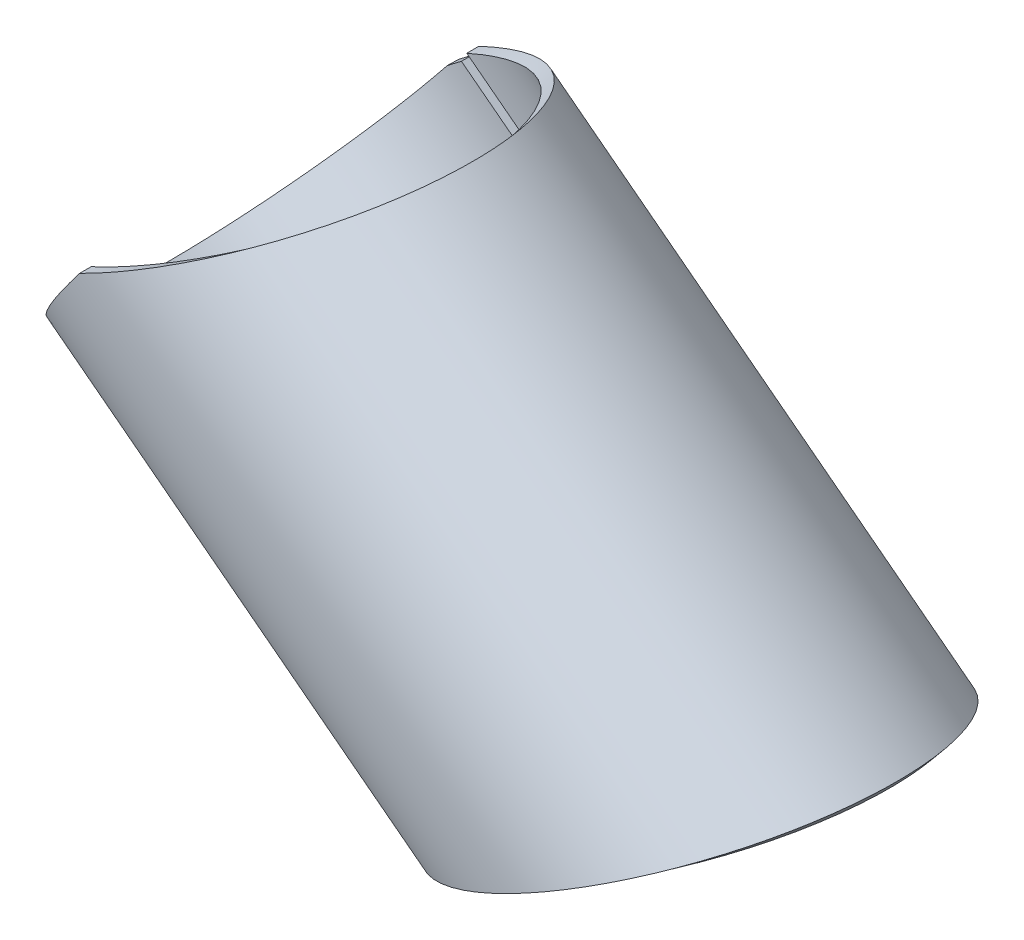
ISO-10303-21;
HEADER;
FILE_DESCRIPTION(('STEP AP214'),'2;1');
FILE_NAME('part.step','',(''),(''),'','','');
FILE_SCHEMA(('AUTOMOTIVE_DESIGN { 1 0 10303 214 1 1 1 1 }'));
ENDSEC;
DATA;
#1=APPLICATION_CONTEXT('core data for automotive mechanical design processes');
#2=APPLICATION_PROTOCOL_DEFINITION('international standard','automotive_design',2000,#1);
#3=PRODUCT_CONTEXT('',#1,'mechanical');
#4=PRODUCT('Part','Part','',(#3));
#5=PRODUCT_RELATED_PRODUCT_CATEGORY('part','',(#4));
#6=PRODUCT_DEFINITION_FORMATION('','',#4);
#7=PRODUCT_DEFINITION_CONTEXT('part definition',#1,'design');
#8=PRODUCT_DEFINITION('design','',#6,#7);
#9=PRODUCT_DEFINITION_SHAPE('','',#8);
#10=(LENGTH_UNIT() NAMED_UNIT(*) SI_UNIT(.MILLI.,.METRE.));
#11=(NAMED_UNIT(*) PLANE_ANGLE_UNIT() SI_UNIT($,.RADIAN.));
#12=(NAMED_UNIT(*) SI_UNIT($,.STERADIAN.) SOLID_ANGLE_UNIT());
#13=UNCERTAINTY_MEASURE_WITH_UNIT(LENGTH_MEASURE(1.E-05),#10,'distance_accuracy_value','');
#14=(GEOMETRIC_REPRESENTATION_CONTEXT(3) GLOBAL_UNCERTAINTY_ASSIGNED_CONTEXT((#13)) GLOBAL_UNIT_ASSIGNED_CONTEXT((#10,
#11,#12)) REPRESENTATION_CONTEXT('',''));
#15=CARTESIAN_POINT('',(0.,0.,0.));
#16=DIRECTION('',(0.,0.,1.));
#17=DIRECTION('',(1.,0.,0.));
#18=AXIS2_PLACEMENT_3D('',#15,#16,#17);
#19=CARTESIAN_POINT('',(0.,0.,16.9771800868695));
#20=CARTESIAN_POINT('',(0.794520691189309,0.391752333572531,16.9771800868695));
#21=CARTESIAN_POINT('',(1.47345548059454,0.727047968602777,16.9225666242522));
#22=CARTESIAN_POINT('',(2.31728449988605,1.14291207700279,16.820635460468));
#23=CARTESIAN_POINT('',(2.56950000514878,1.26711199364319,16.783108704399));
#24=CARTESIAN_POINT('',(2.90449814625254,1.43212642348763,16.7272582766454));
#25=CARTESIAN_POINT('',(3.00872639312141,1.48347970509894,16.7087415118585));
#26=CARTESIAN_POINT('',(3.20369716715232,1.57961184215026,16.6724563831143));
#27=CARTESIAN_POINT('',(3.30020361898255,1.62720155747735,16.6536114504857));
#28=CARTESIAN_POINT('',(4.15991677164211,2.05117687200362,16.478092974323));
#29=CARTESIAN_POINT('',(4.86097558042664,2.39693339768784,16.2803040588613));
#30=CARTESIAN_POINT('',(5.65806381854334,2.7898215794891,16.0074604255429));
#31=CARTESIAN_POINT('',(5.81353262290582,2.86645067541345,15.951593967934));
#32=CARTESIAN_POINT('',(6.11661127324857,3.01586224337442,15.837859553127));
#33=CARTESIAN_POINT('',(6.26420099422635,3.08863951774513,15.780023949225));
#34=CARTESIAN_POINT('',(6.70258671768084,3.30481869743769,15.601253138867));
#35=CARTESIAN_POINT('',(6.98652229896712,3.44485025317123,15.4759554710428));
#36=CARTESIAN_POINT('',(7.81323542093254,3.85251326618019,15.0847024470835));
#37=CARTESIAN_POINT('',(8.33087674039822,4.10765756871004,14.80343819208));
#38=CARTESIAN_POINT('',(9.05743550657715,4.46588076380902,14.3620117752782));
#39=CARTESIAN_POINT('',(9.29196521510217,4.58154531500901,14.2112502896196));
#40=CARTESIAN_POINT('',(9.7497948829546,4.80731430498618,13.9011228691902));
#41=CARTESIAN_POINT('',(9.97249355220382,4.91712741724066,13.7421139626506));
#42=CARTESIAN_POINT('',(10.6219171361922,5.23732142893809,13.2548479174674));
#43=CARTESIAN_POINT('',(11.0299502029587,5.43843169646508,12.9163729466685));
#44=CARTESIAN_POINT('',(11.7965636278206,5.81644154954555,12.2201926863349));
#45=CARTESIAN_POINT('',(12.1573460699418,5.99440045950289,11.8606212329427));
#46=CARTESIAN_POINT('',(12.8380530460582,6.33002911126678,11.1202372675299));
#47=CARTESIAN_POINT('',(13.1572960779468,6.48738205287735,10.7400266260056));
#48=CARTESIAN_POINT('',(13.7537610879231,6.7814255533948,9.96482227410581));
#49=CARTESIAN_POINT('',(14.0310640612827,6.91820177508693,9.56985764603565));
#50=CARTESIAN_POINT('',(14.5484464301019,7.17333885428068,8.76326076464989));
#51=CARTESIAN_POINT('',(14.7879113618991,7.29139943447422,8.35238309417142));
#52=CARTESIAN_POINT('',(15.2284197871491,7.50854515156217,7.51937688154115));
#53=CARTESIAN_POINT('',(15.4291542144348,7.60746939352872,7.09803599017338));
#54=CARTESIAN_POINT('',(15.7941812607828,7.78758760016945,6.24350034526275));
#55=CARTESIAN_POINT('',(15.9585222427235,7.86877235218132,5.81003145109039));
#56=CARTESIAN_POINT('',(16.3966110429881,8.08516088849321,4.49574114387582));
#57=CARTESIAN_POINT('',(16.6153459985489,8.19309639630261,3.60106360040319));
#58=CARTESIAN_POINT('',(16.8332578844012,8.30024836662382,2.24988431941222));
#59=CARTESIAN_POINT('',(16.8875500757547,8.32686651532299,1.79795824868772));
#60=CARTESIAN_POINT('',(16.959640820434,8.36216056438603,0.894036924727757));
#61=CARTESIAN_POINT('',(16.9774390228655,8.37084967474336,0.442789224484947));
#62=CARTESIAN_POINT('',(16.976617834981,8.37058567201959,-0.912243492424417));
#63=CARTESIAN_POINT('',(16.903566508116,8.33496731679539,-1.8202414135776));
#64=CARTESIAN_POINT('',(16.610900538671,8.19081921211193,-3.6218798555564));
#65=CARTESIAN_POINT('',(16.3912800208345,8.08228180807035,-4.51549921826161));
#66=CARTESIAN_POINT('',(15.8063185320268,7.79339372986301,-6.26388011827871));
#67=CARTESIAN_POINT('',(15.4418584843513,7.61384117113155,-7.11740242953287));
#68=CARTESIAN_POINT('',(14.7808039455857,7.28784158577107,-8.36500114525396));
#69=CARTESIAN_POINT('',(14.5419410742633,7.1699949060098,-8.77426602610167));
#70=CARTESIAN_POINT('',(14.0231422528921,6.91426656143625,-9.58152812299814));
#71=CARTESIAN_POINT('',(13.7434835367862,6.77645073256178,-9.97899933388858));
#72=CARTESIAN_POINT('',(13.1434327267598,6.48063595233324,-10.7570017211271));
#73=CARTESIAN_POINT('',(12.8230393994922,6.32263539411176,-11.1375314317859));
#74=CARTESIAN_POINT('',(12.1416161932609,5.98657730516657,-11.8767713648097));
#75=CARTESIAN_POINT('',(11.7815591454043,5.80904436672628,-12.2346890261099));
#76=CARTESIAN_POINT('',(11.0129150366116,5.43013562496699,-12.9308597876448));
#77=CARTESIAN_POINT('',(10.604963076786,5.22900971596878,-13.2683012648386));
#78=CARTESIAN_POINT('',(9.74172559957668,4.80331874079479,-13.914489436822));
#79=CARTESIAN_POINT('',(9.2884554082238,4.57979292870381,-14.2221384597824));
#80=CARTESIAN_POINT('',(8.32032852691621,4.10248259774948,-14.8093339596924));
#81=CARTESIAN_POINT('',(7.80629900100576,3.84900554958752,-15.0880080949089));
#82=CARTESIAN_POINT('',(7.12639916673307,3.51375523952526,-15.4097856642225));
#83=CARTESIAN_POINT('',(6.98855405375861,3.44578888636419,-15.4728102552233));
#84=CARTESIAN_POINT('',(6.70914844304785,3.30804301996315,-15.5959896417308));
#85=CARTESIAN_POINT('',(6.56799637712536,3.23846914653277,-15.6559820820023));
#86=CARTESIAN_POINT('',(6.1348725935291,3.02499485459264,-15.8330002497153));
#87=CARTESIAN_POINT('',(5.83369183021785,2.87655313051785,-15.9468137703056));
#88=CARTESIAN_POINT('',(5.20633650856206,2.56724841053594,-16.1625163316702));
#89=CARTESIAN_POINT('',(4.88016059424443,2.40638364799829,-16.264404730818));
#90=CARTESIAN_POINT('',(4.37220676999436,2.15584271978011,-16.4054484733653));
#91=CARTESIAN_POINT('',(4.19977558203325,2.0707907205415,-16.4504962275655));
#92=CARTESIAN_POINT('',(3.93648315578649,1.94093674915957,-16.5147447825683));
#93=CARTESIAN_POINT('',(3.84794486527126,1.89727292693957,-16.5356070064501));
#94=CARTESIAN_POINT('',(3.66932558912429,1.80919425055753,-16.5761600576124));
#95=CARTESIAN_POINT('',(3.58025470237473,1.76527369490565,-16.5956474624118));
#96=CARTESIAN_POINT('',(3.11402785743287,1.53548566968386,-16.6934792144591));
#97=CARTESIAN_POINT('',(2.67893832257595,1.32125339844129,-16.7719503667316));
#98=CARTESIAN_POINT('',(1.68327745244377,0.830336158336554,-16.9009525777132));
#99=CARTESIAN_POINT('',(1.12272147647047,0.553601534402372,-16.9514669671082));
#100=CARTESIAN_POINT('',(0.500000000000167,0.246529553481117,-16.9698156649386));
#101=CARTESIAN_POINT('',(0.,0.,15.9771800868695));
#102=CARTESIAN_POINT('',(0.766020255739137,0.354625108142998,15.9771800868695));
#103=CARTESIAN_POINT('',(1.42059572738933,0.658179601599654,15.9257834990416));
#104=CARTESIAN_POINT('',(2.23416706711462,1.03462247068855,15.8298563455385));
#105=CARTESIAN_POINT('',(2.47734155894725,1.14704329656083,15.7945400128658));
#106=CARTESIAN_POINT('',(2.80032982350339,1.29641065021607,15.7419793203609));
#107=CARTESIAN_POINT('',(2.90082108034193,1.34289519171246,15.7245532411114));
#108=CARTESIAN_POINT('',(3.08879939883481,1.42991720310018,15.6904054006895));
#109=CARTESIAN_POINT('',(3.18184455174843,1.47299736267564,15.6726704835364));
#110=CARTESIAN_POINT('',(4.01072240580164,1.85679888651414,15.5074905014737));
#111=CARTESIAN_POINT('',(4.6866357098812,2.16979457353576,15.3213518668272));
#112=CARTESIAN_POINT('',(5.45514059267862,2.5254429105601,15.0645794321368));
#113=CARTESIAN_POINT('',(5.60503439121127,2.59480860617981,15.0120036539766));
#114=CARTESIAN_POINT('',(5.89724407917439,2.73005953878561,14.904968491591));
#115=CARTESIAN_POINT('',(6.03954043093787,2.79594034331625,14.8505395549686));
#116=CARTESIAN_POINT('',(6.4622030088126,2.99163461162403,14.6822988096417));
#117=CARTESIAN_POINT('',(6.73595450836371,3.11839782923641,14.5643814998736));
#118=CARTESIAN_POINT('',(7.53301702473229,3.48743052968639,14.1961742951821));
#119=CARTESIAN_POINT('',(8.03209596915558,3.71839082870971,13.9314772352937));
#120=CARTESIAN_POINT('',(8.73259772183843,4.04266562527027,13.5160519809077));
#121=CARTESIAN_POINT('',(8.95871544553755,4.14737061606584,13.37417073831));
#122=CARTESIAN_POINT('',(9.40012454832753,4.35174606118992,13.0823106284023));
#123=CARTESIAN_POINT('',(9.61483605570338,4.45115309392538,12.9326677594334));
#124=CARTESIAN_POINT('',(10.2409689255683,4.74100278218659,12.4741029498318));
#125=CARTESIAN_POINT('',(10.6343703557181,4.92305021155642,12.1555650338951));
#126=CARTESIAN_POINT('',(11.3734891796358,5.26523870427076,11.5003915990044));
#127=CARTESIAN_POINT('',(11.7213304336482,5.42633717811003,11.1619998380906));
#128=CARTESIAN_POINT('',(12.3776244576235,5.73015939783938,10.4652264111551));
#129=CARTESIAN_POINT('',(12.6854196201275,5.87259747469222,10.1074111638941));
#130=CARTESIAN_POINT('',(13.2604943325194,6.13877261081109,9.37786836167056));
#131=CARTESIAN_POINT('',(13.5278506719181,6.26258985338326,9.00616817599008));
#132=CARTESIAN_POINT('',(14.0266765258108,6.49355056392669,8.24708194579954));
#133=CARTESIAN_POINT('',(14.2575535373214,6.6004223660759,7.86040603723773));
#134=CARTESIAN_POINT('',(14.6822649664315,6.79698695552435,7.07646605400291));
#135=CARTESIAN_POINT('',(14.8758016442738,6.88653360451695,6.67994323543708));
#136=CARTESIAN_POINT('',(15.2277333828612,7.04959058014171,5.87574195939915));
#137=CARTESIAN_POINT('',(15.3861760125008,7.12309065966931,5.4678055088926));
#138=CARTESIAN_POINT('',(15.8085421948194,7.31899497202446,4.2309303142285));
#139=CARTESIAN_POINT('',(16.0194299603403,7.41670676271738,3.38895160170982));
#140=CARTESIAN_POINT('',(16.2295349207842,7.51368747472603,2.11736028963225));
#141=CARTESIAN_POINT('',(16.2818842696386,7.53777438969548,1.69205383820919));
#142=CARTESIAN_POINT('',(16.3513966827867,7.56970925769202,0.84137582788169));
#143=CARTESIAN_POINT('',(16.3685590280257,7.57756994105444,0.416707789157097));
#144=CARTESIAN_POINT('',(16.3677632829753,7.57733908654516,-0.858509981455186));
#145=CARTESIAN_POINT('',(16.2973204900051,7.54511926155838,-1.71302446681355));
#146=CARTESIAN_POINT('',(16.0151463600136,7.4146404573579,-3.40854172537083));
#147=CARTESIAN_POINT('',(15.8034094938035,7.31637427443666,-4.24952458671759));
#148=CARTESIAN_POINT('',(15.2394404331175,7.05483619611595,-5.89492131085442));
#149=CARTESIAN_POINT('',(14.8880472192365,6.89230777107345,-6.69816894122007));
#150=CARTESIAN_POINT('',(14.2507025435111,6.59719859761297,-7.87228085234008));
#151=CARTESIAN_POINT('',(14.0204083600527,6.49051563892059,-8.25743896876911));
#152=CARTESIAN_POINT('',(13.5202138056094,6.25902587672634,-9.01715123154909));
#153=CARTESIAN_POINT('',(13.2505827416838,6.13427458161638,-9.39121035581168));
#154=CARTESIAN_POINT('',(12.6720509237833,5.86649583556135,-10.1233863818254));
#155=CARTESIAN_POINT('',(12.3631490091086,5.72346687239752,-10.4815019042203));
#156=CARTESIAN_POINT('',(11.7061666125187,5.41925150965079,-11.1771986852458));
#157=CARTESIAN_POINT('',(11.3590227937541,5.25854258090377,-11.514034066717));
#158=CARTESIAN_POINT('',(10.6179432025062,4.91554629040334,-12.1691985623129));
#159=CARTESIAN_POINT('',(10.2246215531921,4.73348149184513,-12.486763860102));
#160=CARTESIAN_POINT('',(9.39234514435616,4.34812816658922,-13.094889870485));
#161=CARTESIAN_POINT('',(8.95533213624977,4.14578303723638,-13.3844175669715));
#162=CARTESIAN_POINT('',(8.0219253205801,3.71370776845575,-13.9370257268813));
#163=CARTESIAN_POINT('',(7.52633186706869,3.48425017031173,-14.1992852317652));
#164=CARTESIAN_POINT('',(6.87081659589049,3.18076930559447,-14.5021092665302));
#165=CARTESIAN_POINT('',(6.73791519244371,3.11924386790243,-14.5614215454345));
#166=CARTESIAN_POINT('',(6.4685297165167,2.99455274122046,-14.677345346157));
#167=CARTESIAN_POINT('',(6.33243930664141,2.93157344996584,-14.7338040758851));
#168=CARTESIAN_POINT('',(5.91484681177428,2.73833410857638,-14.9003954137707));
#169=CARTESIAN_POINT('',(5.62446597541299,2.60396307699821,-15.0075050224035));
#170=CARTESIAN_POINT('',(5.01960967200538,2.3239712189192,-15.2105021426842));
#171=CARTESIAN_POINT('',(4.7051329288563,2.17834872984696,-15.3063890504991));
#172=CARTESIAN_POINT('',(4.21539897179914,1.95154556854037,-15.4391249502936));
#173=CARTESIAN_POINT('',(4.04915282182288,1.87455175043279,-15.4815192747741));
#174=CARTESIAN_POINT('',(3.79530414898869,1.75700157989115,-15.5419834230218));
#175=CARTESIAN_POINT('',(3.70994146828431,1.71747510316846,-15.561616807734));
#176=CARTESIAN_POINT('',(3.53772846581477,1.63774284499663,-15.599781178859));
#177=CARTESIAN_POINT('',(3.4518521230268,1.59798430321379,-15.6181207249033));
#178=CARTESIAN_POINT('',(3.00234355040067,1.38997769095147,-15.7101899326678));
#179=CARTESIAN_POINT('',(2.58284979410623,1.19606439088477,-15.7840389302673));
#180=CARTESIAN_POINT('',(1.62289735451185,0.751669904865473,-15.9054425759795));
#181=CARTESIAN_POINT('',(1.08245306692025,0.501139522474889,-15.9529815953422));
#182=CARTESIAN_POINT('',(0.482067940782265,0.22316675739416,-15.9702494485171));
#183=B_SPLINE_SURFACE_WITH_KNOTS('',1,3,((#19,#20,#21,#22,#23,#24,#25,#26,#27,#28,#29,#30,#31,
#32,#33,#34,#35,#36,#37,#38,#39,#40,#41,#42,#43,#44,#45,#46,#47,#48,#49,#50,#51,#52,#53,#54,#55,
#56,#57,#58,#59,#60,#61,#62,#63,#64,#65,#66,#67,#68,#69,#70,#71,#72,#73,#74,#75,#76,#77,#78,#79,
#80,#81,#82,#83,#84,#85,#86,#87,#88,#89,#90,#91,#92,#93,#94,#95,#96,#97,#98,#99,#100),(#101,
#102,#103,#104,#105,#106,#107,#108,#109,#110,#111,#112,#113,#114,#115,#116,#117,#118,#119,#120,
#121,#122,#123,#124,#125,#126,#127,#128,#129,#130,#131,#132,#133,#134,#135,#136,#137,#138,#139,
#140,#141,#142,#143,#144,#145,#146,#147,#148,#149,#150,#151,#152,#153,#154,#155,#156,#157,#158,
#159,#160,#161,#162,#163,#164,#165,#166,#167,#168,#169,#170,#171,#172,#173,#174,#175,#176,#177,
#178,#179,#180,#181,#182)),.UNSPECIFIED.,.F.,.F.,.F.,(2,2),(4,2,2,2,2,2,2,2,2,2,2,2,2,2,2,2,2,2,
2,2,2,2,2,2,2,2,2,2,2,2,2,2,2,2,2,2,2,2,2,2,4),(0.,1.),(0.,0.015625,0.0234375,0.02734375,
0.03125,0.0625,0.0703125,0.078125,0.09375,0.125,0.140625,0.15625,0.1875,0.21875,0.25,0.28125,
0.3125,0.34375,0.375,0.4375,0.46875,0.5,0.5625,0.625,0.6875,0.71875,0.75,0.78125,0.8125,0.84375,
0.875,0.90625,0.9140625,0.921875,0.9375,0.953125,0.9609375,0.96484375,0.96875,0.984375,1.),.UNSPECIFIED.);
#184=CARTESIAN_POINT('',(0.500000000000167,0.246529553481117,-16.9698156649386));
#185=CARTESIAN_POINT('',(0.482067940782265,0.22316675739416,-15.9702494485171));
#186=B_SPLINE_CURVE_WITH_KNOTS('',1,(#184,#185),.UNSPECIFIED.,.F.,.F.,(2,2),(0.,1.),.UNSPECIFIED.);
#187=CARTESIAN_POINT('',(0.482067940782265,0.22316675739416,-15.9702494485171));
#188=VERTEX_POINT('',#187);
#189=CARTESIAN_POINT('',(0.500000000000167,0.246529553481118,-16.9698156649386));
#190=VERTEX_POINT('',#189);
#191=EDGE_CURVE('E13',#188,#190,#186,.F.);
#192=CARTESIAN_POINT('',(0.482067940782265,0.22316675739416,-15.9702494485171));
#193=CARTESIAN_POINT('',(1.08245306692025,0.501139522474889,-15.9529815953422));
#194=CARTESIAN_POINT('',(1.62289735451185,0.751669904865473,-15.9054425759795));
#195=CARTESIAN_POINT('',(2.58284979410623,1.19606439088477,-15.7840389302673));
#196=CARTESIAN_POINT('',(3.00234355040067,1.38997769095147,-15.7101899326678));
#197=CARTESIAN_POINT('',(3.4518521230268,1.59798430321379,-15.6181207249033));
#198=CARTESIAN_POINT('',(3.53772846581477,1.63774284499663,-15.599781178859));
#199=CARTESIAN_POINT('',(3.70994146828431,1.71747510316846,-15.561616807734));
#200=CARTESIAN_POINT('',(3.79530414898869,1.75700157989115,-15.5419834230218));
#201=CARTESIAN_POINT('',(4.04915282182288,1.87455175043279,-15.4815192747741));
#202=CARTESIAN_POINT('',(4.21539897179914,1.95154556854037,-15.4391249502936));
#203=CARTESIAN_POINT('',(4.7051329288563,2.17834872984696,-15.3063890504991));
#204=CARTESIAN_POINT('',(5.01960967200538,2.3239712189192,-15.2105021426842));
#205=CARTESIAN_POINT('',(5.62446597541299,2.60396307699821,-15.0075050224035));
#206=CARTESIAN_POINT('',(5.91484681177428,2.73833410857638,-14.9003954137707));
#207=CARTESIAN_POINT('',(6.33243930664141,2.93157344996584,-14.7338040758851));
#208=CARTESIAN_POINT('',(6.4685297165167,2.99455274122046,-14.677345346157));
#209=CARTESIAN_POINT('',(6.73791519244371,3.11924386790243,-14.5614215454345));
#210=CARTESIAN_POINT('',(6.87081659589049,3.18076930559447,-14.5021092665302));
#211=CARTESIAN_POINT('',(7.52633186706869,3.48425017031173,-14.1992852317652));
#212=CARTESIAN_POINT('',(8.0219253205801,3.71370776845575,-13.9370257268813));
#213=CARTESIAN_POINT('',(8.95533213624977,4.14578303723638,-13.3844175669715));
#214=CARTESIAN_POINT('',(9.39234514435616,4.34812816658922,-13.094889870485));
#215=CARTESIAN_POINT('',(10.2246215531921,4.73348149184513,-12.486763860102));
#216=CARTESIAN_POINT('',(10.6179432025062,4.91554629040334,-12.1691985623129));
#217=CARTESIAN_POINT('',(11.3590227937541,5.25854258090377,-11.514034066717));
#218=CARTESIAN_POINT('',(11.7061666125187,5.41925150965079,-11.1771986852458));
#219=CARTESIAN_POINT('',(12.3631490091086,5.72346687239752,-10.4815019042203));
#220=CARTESIAN_POINT('',(12.6720509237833,5.86649583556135,-10.1233863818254));
#221=CARTESIAN_POINT('',(13.2505827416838,6.13427458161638,-9.39121035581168));
#222=CARTESIAN_POINT('',(13.5202138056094,6.25902587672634,-9.01715123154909));
#223=CARTESIAN_POINT('',(14.0204083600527,6.49051563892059,-8.25743896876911));
#224=CARTESIAN_POINT('',(14.2507025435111,6.59719859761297,-7.87228085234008));
#225=CARTESIAN_POINT('',(14.8880472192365,6.89230777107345,-6.69816894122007));
#226=CARTESIAN_POINT('',(15.2394404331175,7.05483619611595,-5.89492131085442));
#227=CARTESIAN_POINT('',(15.8034094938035,7.31637427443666,-4.24952458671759));
#228=CARTESIAN_POINT('',(16.0151463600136,7.4146404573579,-3.40854172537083));
#229=CARTESIAN_POINT('',(16.2973204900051,7.54511926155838,-1.71302446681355));
#230=CARTESIAN_POINT('',(16.3677632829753,7.57733908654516,-0.858509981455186));
#231=CARTESIAN_POINT('',(16.3685590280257,7.57756994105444,0.416707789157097));
#232=CARTESIAN_POINT('',(16.3513966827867,7.56970925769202,0.84137582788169));
#233=CARTESIAN_POINT('',(16.2818842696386,7.53777438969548,1.69205383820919));
#234=CARTESIAN_POINT('',(16.2295349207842,7.51368747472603,2.11736028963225));
#235=CARTESIAN_POINT('',(16.0194299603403,7.41670676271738,3.38895160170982));
#236=CARTESIAN_POINT('',(15.8085421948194,7.31899497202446,4.2309303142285));
#237=CARTESIAN_POINT('',(15.3861760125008,7.12309065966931,5.4678055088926));
#238=CARTESIAN_POINT('',(15.2277333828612,7.04959058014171,5.87574195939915));
#239=CARTESIAN_POINT('',(14.8758016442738,6.88653360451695,6.67994323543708));
#240=CARTESIAN_POINT('',(14.6822649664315,6.79698695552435,7.07646605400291));
#241=CARTESIAN_POINT('',(14.2575535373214,6.6004223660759,7.86040603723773));
#242=CARTESIAN_POINT('',(14.0266765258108,6.49355056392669,8.24708194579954));
#243=CARTESIAN_POINT('',(13.5278506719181,6.26258985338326,9.00616817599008));
#244=CARTESIAN_POINT('',(13.2604943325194,6.13877261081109,9.37786836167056));
#245=CARTESIAN_POINT('',(12.6854196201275,5.87259747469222,10.1074111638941));
#246=CARTESIAN_POINT('',(12.3776244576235,5.73015939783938,10.4652264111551));
#247=CARTESIAN_POINT('',(11.7213304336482,5.42633717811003,11.1619998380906));
#248=CARTESIAN_POINT('',(11.3734891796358,5.26523870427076,11.5003915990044));
#249=CARTESIAN_POINT('',(10.6343703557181,4.92305021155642,12.1555650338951));
#250=CARTESIAN_POINT('',(10.2409689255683,4.74100278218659,12.4741029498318));
#251=CARTESIAN_POINT('',(9.61483605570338,4.45115309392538,12.9326677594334));
#252=CARTESIAN_POINT('',(9.40012454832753,4.35174606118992,13.0823106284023));
#253=CARTESIAN_POINT('',(8.95871544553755,4.14737061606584,13.37417073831));
#254=CARTESIAN_POINT('',(8.73259772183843,4.04266562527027,13.5160519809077));
#255=CARTESIAN_POINT('',(8.03209596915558,3.71839082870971,13.9314772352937));
#256=CARTESIAN_POINT('',(7.53301702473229,3.48743052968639,14.1961742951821));
#257=CARTESIAN_POINT('',(6.73595450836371,3.11839782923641,14.5643814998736));
#258=CARTESIAN_POINT('',(6.4622030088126,2.99163461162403,14.6822988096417));
#259=CARTESIAN_POINT('',(6.03954043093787,2.79594034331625,14.8505395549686));
#260=CARTESIAN_POINT('',(5.89724407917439,2.73005953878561,14.904968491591));
#261=CARTESIAN_POINT('',(5.60503439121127,2.59480860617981,15.0120036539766));
#262=CARTESIAN_POINT('',(5.45514059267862,2.5254429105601,15.0645794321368));
#263=CARTESIAN_POINT('',(4.6866357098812,2.16979457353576,15.3213518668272));
#264=CARTESIAN_POINT('',(4.01072240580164,1.85679888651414,15.5074905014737));
#265=CARTESIAN_POINT('',(3.18184455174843,1.47299736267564,15.6726704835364));
#266=CARTESIAN_POINT('',(3.08879939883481,1.42991720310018,15.6904054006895));
#267=CARTESIAN_POINT('',(2.90082108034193,1.34289519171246,15.7245532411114));
#268=CARTESIAN_POINT('',(2.80032982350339,1.29641065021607,15.7419793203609));
#269=CARTESIAN_POINT('',(2.47734155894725,1.14704329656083,15.7945400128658));
#270=CARTESIAN_POINT('',(2.23416706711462,1.03462247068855,15.8298563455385));
#271=CARTESIAN_POINT('',(1.42059572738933,0.658179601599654,15.9257834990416));
#272=CARTESIAN_POINT('',(0.766020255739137,0.354625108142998,15.9771800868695));
#273=CARTESIAN_POINT('',(0.,0.,15.9771800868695));
#274=B_SPLINE_CURVE_WITH_KNOTS('',3,(#192,#193,#194,#195,#196,#197,#198,#199,#200,#201,#202,
#203,#204,#205,#206,#207,#208,#209,#210,#211,#212,#213,#214,#215,#216,#217,#218,#219,#220,#221,
#222,#223,#224,#225,#226,#227,#228,#229,#230,#231,#232,#233,#234,#235,#236,#237,#238,#239,#240,
#241,#242,#243,#244,#245,#246,#247,#248,#249,#250,#251,#252,#253,#254,#255,#256,#257,#258,#259,
#260,#261,#262,#263,#264,#265,#266,#267,#268,#269,#270,#271,#272,#273),.UNSPECIFIED.,.F.,.F.,(4,
2,2,2,2,2,2,2,2,2,2,2,2,2,2,2,2,2,2,2,2,2,2,2,2,2,2,2,2,2,2,2,2,2,2,2,2,2,2,2,4),(0.,0.015625,
0.03125,0.03515625,0.0390625,0.046875,0.0625,0.078125,0.0859375,0.09375,0.125,0.15625,0.1875,
0.21875,0.25,0.28125,0.3125,0.375,0.4375,0.5,0.53125,0.5625,0.625,0.65625,0.6875,0.71875,0.75,
0.78125,0.8125,0.84375,0.859375,0.875,0.90625,0.921875,0.9296875,0.9375,0.96875,0.97265625,
0.9765625,0.984375,1.),.UNSPECIFIED.);
#275=CARTESIAN_POINT('',(0.,0.,15.9771800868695));
#276=VERTEX_POINT('',#275);
#277=EDGE_CURVE('E108',#276,#188,#274,.F.);
#278=CARTESIAN_POINT('',(0.,0.,15.9771800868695));
#279=CARTESIAN_POINT('',(0.,0.,16.9771800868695));
#280=B_SPLINE_CURVE_WITH_KNOTS('',1,(#278,#279),.UNSPECIFIED.,.F.,.F.,(2,2),(0.,1.),.UNSPECIFIED.);
#281=CARTESIAN_POINT('',(0.,0.,16.9771800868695));
#282=VERTEX_POINT('',#281);
#283=EDGE_CURVE('E52',#276,#282,#280,.T.);
#284=CARTESIAN_POINT('',(0.,0.,16.9771800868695));
#285=CARTESIAN_POINT('',(0.794520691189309,0.391752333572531,16.9771800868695));
#286=CARTESIAN_POINT('',(1.47345548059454,0.727047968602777,16.9225666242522));
#287=CARTESIAN_POINT('',(2.31728449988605,1.14291207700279,16.820635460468));
#288=CARTESIAN_POINT('',(2.56950000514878,1.26711199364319,16.783108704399));
#289=CARTESIAN_POINT('',(2.90449814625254,1.43212642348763,16.7272582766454));
#290=CARTESIAN_POINT('',(3.00872639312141,1.48347970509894,16.7087415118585));
#291=CARTESIAN_POINT('',(3.20369716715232,1.57961184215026,16.6724563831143));
#292=CARTESIAN_POINT('',(3.30020361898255,1.62720155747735,16.6536114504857));
#293=CARTESIAN_POINT('',(4.15991677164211,2.05117687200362,16.478092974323));
#294=CARTESIAN_POINT('',(4.86097558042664,2.39693339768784,16.2803040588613));
#295=CARTESIAN_POINT('',(5.65806381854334,2.7898215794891,16.0074604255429));
#296=CARTESIAN_POINT('',(5.81353262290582,2.86645067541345,15.951593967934));
#297=CARTESIAN_POINT('',(6.11661127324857,3.01586224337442,15.837859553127));
#298=CARTESIAN_POINT('',(6.26420099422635,3.08863951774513,15.780023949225));
#299=CARTESIAN_POINT('',(6.70258671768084,3.30481869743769,15.601253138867));
#300=CARTESIAN_POINT('',(6.98652229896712,3.44485025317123,15.4759554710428));
#301=CARTESIAN_POINT('',(7.81323542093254,3.85251326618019,15.0847024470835));
#302=CARTESIAN_POINT('',(8.33087674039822,4.10765756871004,14.80343819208));
#303=CARTESIAN_POINT('',(9.05743550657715,4.46588076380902,14.3620117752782));
#304=CARTESIAN_POINT('',(9.29196521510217,4.58154531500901,14.2112502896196));
#305=CARTESIAN_POINT('',(9.7497948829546,4.80731430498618,13.9011228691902));
#306=CARTESIAN_POINT('',(9.97249355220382,4.91712741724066,13.7421139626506));
#307=CARTESIAN_POINT('',(10.6219171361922,5.23732142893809,13.2548479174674));
#308=CARTESIAN_POINT('',(11.0299502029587,5.43843169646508,12.9163729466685));
#309=CARTESIAN_POINT('',(11.7965636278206,5.81644154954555,12.2201926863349));
#310=CARTESIAN_POINT('',(12.1573460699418,5.99440045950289,11.8606212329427));
#311=CARTESIAN_POINT('',(12.8380530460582,6.33002911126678,11.1202372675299));
#312=CARTESIAN_POINT('',(13.1572960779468,6.48738205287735,10.7400266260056));
#313=CARTESIAN_POINT('',(13.7537610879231,6.7814255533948,9.96482227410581));
#314=CARTESIAN_POINT('',(14.0310640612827,6.91820177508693,9.56985764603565));
#315=CARTESIAN_POINT('',(14.5484464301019,7.17333885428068,8.76326076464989));
#316=CARTESIAN_POINT('',(14.7879113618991,7.29139943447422,8.35238309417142));
#317=CARTESIAN_POINT('',(15.2284197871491,7.50854515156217,7.51937688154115));
#318=CARTESIAN_POINT('',(15.4291542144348,7.60746939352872,7.09803599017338));
#319=CARTESIAN_POINT('',(15.7941812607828,7.78758760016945,6.24350034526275));
#320=CARTESIAN_POINT('',(15.9585222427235,7.86877235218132,5.81003145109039));
#321=CARTESIAN_POINT('',(16.3966110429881,8.08516088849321,4.49574114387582));
#322=CARTESIAN_POINT('',(16.6153459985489,8.19309639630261,3.60106360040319));
#323=CARTESIAN_POINT('',(16.8332578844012,8.30024836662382,2.24988431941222));
#324=CARTESIAN_POINT('',(16.8875500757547,8.32686651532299,1.79795824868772));
#325=CARTESIAN_POINT('',(16.959640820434,8.36216056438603,0.894036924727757));
#326=CARTESIAN_POINT('',(16.9774390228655,8.37084967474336,0.442789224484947));
#327=CARTESIAN_POINT('',(16.976617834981,8.37058567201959,-0.912243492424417));
#328=CARTESIAN_POINT('',(16.903566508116,8.33496731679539,-1.8202414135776));
#329=CARTESIAN_POINT('',(16.610900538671,8.19081921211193,-3.6218798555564));
#330=CARTESIAN_POINT('',(16.3912800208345,8.08228180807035,-4.51549921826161));
#331=CARTESIAN_POINT('',(15.8063185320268,7.79339372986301,-6.26388011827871));
#332=CARTESIAN_POINT('',(15.4418584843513,7.61384117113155,-7.11740242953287));
#333=CARTESIAN_POINT('',(14.7808039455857,7.28784158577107,-8.36500114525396));
#334=CARTESIAN_POINT('',(14.5419410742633,7.1699949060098,-8.77426602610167));
#335=CARTESIAN_POINT('',(14.0231422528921,6.91426656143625,-9.58152812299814));
#336=CARTESIAN_POINT('',(13.7434835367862,6.77645073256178,-9.97899933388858));
#337=CARTESIAN_POINT('',(13.1434327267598,6.48063595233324,-10.7570017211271));
#338=CARTESIAN_POINT('',(12.8230393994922,6.32263539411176,-11.1375314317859));
#339=CARTESIAN_POINT('',(12.1416161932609,5.98657730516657,-11.8767713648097));
#340=CARTESIAN_POINT('',(11.7815591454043,5.80904436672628,-12.2346890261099));
#341=CARTESIAN_POINT('',(11.0129150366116,5.43013562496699,-12.9308597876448));
#342=CARTESIAN_POINT('',(10.604963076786,5.22900971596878,-13.2683012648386));
#343=CARTESIAN_POINT('',(9.74172559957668,4.80331874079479,-13.914489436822));
#344=CARTESIAN_POINT('',(9.2884554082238,4.57979292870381,-14.2221384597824));
#345=CARTESIAN_POINT('',(8.32032852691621,4.10248259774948,-14.8093339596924));
#346=CARTESIAN_POINT('',(7.80629900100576,3.84900554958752,-15.0880080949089));
#347=CARTESIAN_POINT('',(7.12639916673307,3.51375523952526,-15.4097856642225));
#348=CARTESIAN_POINT('',(6.98855405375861,3.44578888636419,-15.4728102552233));
#349=CARTESIAN_POINT('',(6.70914844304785,3.30804301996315,-15.5959896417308));
#350=CARTESIAN_POINT('',(6.56799637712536,3.23846914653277,-15.6559820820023));
#351=CARTESIAN_POINT('',(6.1348725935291,3.02499485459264,-15.8330002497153));
#352=CARTESIAN_POINT('',(5.83369183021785,2.87655313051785,-15.9468137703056));
#353=CARTESIAN_POINT('',(5.20633650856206,2.56724841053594,-16.1625163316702));
#354=CARTESIAN_POINT('',(4.88016059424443,2.40638364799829,-16.264404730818));
#355=CARTESIAN_POINT('',(4.37220676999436,2.15584271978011,-16.4054484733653));
#356=CARTESIAN_POINT('',(4.19977558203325,2.0707907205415,-16.4504962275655));
#357=CARTESIAN_POINT('',(3.93648315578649,1.94093674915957,-16.5147447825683));
#358=CARTESIAN_POINT('',(3.84794486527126,1.89727292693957,-16.5356070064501));
#359=CARTESIAN_POINT('',(3.66932558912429,1.80919425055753,-16.5761600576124));
#360=CARTESIAN_POINT('',(3.58025470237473,1.76527369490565,-16.5956474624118));
#361=CARTESIAN_POINT('',(3.11402785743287,1.53548566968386,-16.6934792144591));
#362=CARTESIAN_POINT('',(2.67893832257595,1.32125339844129,-16.7719503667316));
#363=CARTESIAN_POINT('',(1.68327745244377,0.830336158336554,-16.9009525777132));
#364=CARTESIAN_POINT('',(1.12272147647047,0.553601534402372,-16.9514669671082));
#365=CARTESIAN_POINT('',(0.500000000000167,0.246529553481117,-16.9698156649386));
#366=B_SPLINE_CURVE_WITH_KNOTS('',3,(#284,#285,#286,#287,#288,#289,#290,#291,#292,#293,#294,
#295,#296,#297,#298,#299,#300,#301,#302,#303,#304,#305,#306,#307,#308,#309,#310,#311,#312,#313,
#314,#315,#316,#317,#318,#319,#320,#321,#322,#323,#324,#325,#326,#327,#328,#329,#330,#331,#332,
#333,#334,#335,#336,#337,#338,#339,#340,#341,#342,#343,#344,#345,#346,#347,#348,#349,#350,#351,
#352,#353,#354,#355,#356,#357,#358,#359,#360,#361,#362,#363,#364,#365),.UNSPECIFIED.,.F.,.F.,(4,
2,2,2,2,2,2,2,2,2,2,2,2,2,2,2,2,2,2,2,2,2,2,2,2,2,2,2,2,2,2,2,2,2,2,2,2,2,2,2,4),(0.,0.015625,
0.0234375,0.02734375,0.03125,0.0625,0.0703125,0.078125,0.09375,0.125,0.140625,0.15625,0.1875,
0.21875,0.25,0.28125,0.3125,0.34375,0.375,0.4375,0.46875,0.5,0.5625,0.625,0.6875,0.71875,0.75,
0.78125,0.8125,0.84375,0.875,0.90625,0.9140625,0.921875,0.9375,0.953125,0.9609375,0.96484375,
0.96875,0.984375,1.),.UNSPECIFIED.);
#367=EDGE_CURVE('E106',#282,#190,#366,.T.);
#368=ORIENTED_EDGE('',*,*,#191,.F.);
#369=ORIENTED_EDGE('',*,*,#277,.F.);
#370=ORIENTED_EDGE('',*,*,#283,.T.);
#371=ORIENTED_EDGE('',*,*,#367,.T.);
#372=EDGE_LOOP('',(#368,#369,#370,#371));
#373=FACE_BOUND('',#372,.T.);
#374=ADVANCED_FACE('F40',(#373),#183,.F.);
#375=CARTESIAN_POINT('',(0.,0.,0.));
#376=DIRECTION('',(-0.793268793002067,0.60887159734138,0.));
#377=DIRECTION('',(-0.60887159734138,-0.793268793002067,0.));
#378=AXIS2_PLACEMENT_3D('',#375,#376,#377);
#379=PLANE('',#378);
#380=ORIENTED_EDGE('',*,*,#283,.F.);
#381=CARTESIAN_POINT('',(0.,0.,0.));
#382=DIRECTION('',(0.793268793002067,-0.60887159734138,0.));
#383=DIRECTION('',(0.60887159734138,0.793268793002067,0.));
#384=AXIS2_PLACEMENT_3D('',#381,#382,#383);
#385=CIRCLE('',#384,15.9771800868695);
#386=CARTESIAN_POINT('',(-1.10811410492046,-1.44370724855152,-15.8731873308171));
#387=VERTEX_POINT('',#386);
#388=EDGE_CURVE('E150',#276,#387,#385,.T.);
#389=ORIENTED_EDGE('',*,*,#388,.T.);
#390=CARTESIAN_POINT('',(-1.1774701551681,-1.53406782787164,-16.8666785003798));
#391=CARTESIAN_POINT('',(-1.10811410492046,-1.44370724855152,-15.8731873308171));
#392=B_SPLINE_CURVE_WITH_KNOTS('',1,(#390,#391),.UNSPECIFIED.,.F.,.F.,(2,2),(0.,1.),.UNSPECIFIED.);
#393=CARTESIAN_POINT('',(-1.17747015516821,-1.53406782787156,-16.8666785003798));
#394=VERTEX_POINT('',#393);
#395=EDGE_CURVE('E115',#387,#394,#392,.F.);
#396=ORIENTED_EDGE('',*,*,#395,.T.);
#397=CARTESIAN_POINT('',(0.,0.,0.));
#398=DIRECTION('',(-0.793268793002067,0.60887159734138,0.));
#399=DIRECTION('',(-0.60887159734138,-0.793268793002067,0.));
#400=AXIS2_PLACEMENT_3D('',#397,#398,#399);
#401=CIRCLE('',#400,16.9771800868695);
#402=EDGE_CURVE('E125',#282,#394,#401,.F.);
#403=ORIENTED_EDGE('',*,*,#402,.F.);
#404=EDGE_LOOP('',(#380,#389,#396,#403));
#405=FACE_BOUND('',#404,.T.);
#406=ADVANCED_FACE('F130',(#405),#379,.T.);
#407=CARTESIAN_POINT('',(2.33903066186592E-13,-0.630303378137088,-16.9698156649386));
#408=CARTESIAN_POINT('',(-0.393203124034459,-0.932486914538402,-16.9556987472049));
#409=CARTESIAN_POINT('',(-0.786040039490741,-1.23419425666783,-16.9212786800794));
#410=CARTESIAN_POINT('',(-1.1774701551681,-1.53406782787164,-16.8666785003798));
#411=CARTESIAN_POINT('',(0.0179320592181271,-0.606940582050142,-15.9702494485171));
#412=CARTESIAN_POINT('',(-0.358087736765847,-0.886736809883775,-15.9569640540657));
#413=CARTESIAN_POINT('',(-0.7337628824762,-1.16608492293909,-15.9245714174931));
#414=CARTESIAN_POINT('',(-1.10811410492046,-1.44370724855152,-15.8731873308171));
#415=B_SPLINE_SURFACE_WITH_KNOTS('',1,3,((#407,#408,#409,#410),(#411,#412,#413,#414)),
.UNSPECIFIED.,.F.,.F.,.F.,(2,2),(4,4),(0.,1.),(0.,1.),.UNSPECIFIED.);
#416=CARTESIAN_POINT('',(-1.10811410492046,-1.44370724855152,-15.8731873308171));
#417=CARTESIAN_POINT('',(-0.7337628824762,-1.16608492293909,-15.9245714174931));
#418=CARTESIAN_POINT('',(-0.358087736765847,-0.886736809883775,-15.9569640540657));
#419=CARTESIAN_POINT('',(0.0179320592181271,-0.606940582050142,-15.9702494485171));
#420=B_SPLINE_CURVE_WITH_KNOTS('',3,(#416,#417,#418,#419),.UNSPECIFIED.,.F.,.F.,(4,4),(0.,1.),.UNSPECIFIED.);
#421=CARTESIAN_POINT('',(0.0179320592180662,-0.606940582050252,-15.9702494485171));
#422=VERTEX_POINT('',#421);
#423=EDGE_CURVE('E149',#422,#387,#420,.F.);
#424=CARTESIAN_POINT('',(0.0179320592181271,-0.606940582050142,-15.9702494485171));
#425=CARTESIAN_POINT('',(2.33903066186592E-13,-0.630303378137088,-16.9698156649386));
#426=B_SPLINE_CURVE_WITH_KNOTS('',1,(#424,#425),.UNSPECIFIED.,.F.,.F.,(2,2),(0.,1.),.UNSPECIFIED.);
#427=CARTESIAN_POINT('',(2.33808198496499E-13,-0.630303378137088,-16.9698156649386));
#428=VERTEX_POINT('',#427);
#429=EDGE_CURVE('E282',#422,#428,#426,.T.);
#430=CARTESIAN_POINT('',(2.33903066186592E-13,-0.630303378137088,-16.9698156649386));
#431=CARTESIAN_POINT('',(-0.393203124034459,-0.932486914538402,-16.9556987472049));
#432=CARTESIAN_POINT('',(-0.786040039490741,-1.23419425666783,-16.9212786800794));
#433=CARTESIAN_POINT('',(-1.1774701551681,-1.53406782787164,-16.8666785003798));
#434=B_SPLINE_CURVE_WITH_KNOTS('',3,(#430,#431,#432,#433),.UNSPECIFIED.,.F.,.F.,(4,4),(0.,1.),.UNSPECIFIED.);
#435=EDGE_CURVE('E132',#428,#394,#434,.T.);
#436=ORIENTED_EDGE('',*,*,#395,.F.);
#437=ORIENTED_EDGE('',*,*,#423,.F.);
#438=ORIENTED_EDGE('',*,*,#429,.T.);
#439=ORIENTED_EDGE('',*,*,#435,.T.);
#440=EDGE_LOOP('',(#436,#437,#438,#439));
#441=FACE_BOUND('',#440,.T.);
#442=ADVANCED_FACE('F281',(#441),#415,.F.);
#443=CARTESIAN_POINT('',(18.0614576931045,-14.4562062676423,-15.9702494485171));
#444=DIRECTION('',(-0.608607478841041,-0.792924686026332,0.0294512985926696));
#445=DIRECTION('',(-0.793268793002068,0.608871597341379,0.));
#446=AXIS2_PLACEMENT_3D('',#443,#444,#445);
#447=PLANE('',#446);
#448=ORIENTED_EDGE('',*,*,#429,.F.);
#449=DIRECTION('',(-0.793268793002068,0.608871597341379,0.));
#450=VECTOR('',#449,1.);
#451=CARTESIAN_POINT('',(36.104983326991,-28.3054719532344,-15.9702494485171));
#452=LINE('',#451,#450);
#453=CARTESIAN_POINT('',(36.104983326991,-28.3054719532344,-15.9702494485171));
#454=VERTEX_POINT('',#453);
#455=EDGE_CURVE('E266',#454,#422,#452,.T.);
#456=ORIENTED_EDGE('',*,*,#455,.F.);
#457=CARTESIAN_POINT('',(36.0870512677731,-28.3288347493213,-16.9698156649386));
#458=CARTESIAN_POINT('',(36.104983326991,-28.3054719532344,-15.9702494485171));
#459=B_SPLINE_CURVE_WITH_KNOTS('',1,(#457,#458),.UNSPECIFIED.,.F.,.F.,(2,2),(0.,1.),.UNSPECIFIED.);
#460=CARTESIAN_POINT('',(36.087051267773,-28.3288347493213,-16.9698156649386));
#461=VERTEX_POINT('',#460);
#462=EDGE_CURVE('E95',#454,#461,#459,.F.);
#463=ORIENTED_EDGE('',*,*,#462,.T.);
#464=DIRECTION('',(-0.793268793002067,0.60887159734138,0.));
#465=VECTOR('',#464,1.);
#466=CARTESIAN_POINT('',(150.678444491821,-116.283189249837,-16.9698156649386));
#467=LINE('',#466,#465);
#468=EDGE_CURVE('E134',#461,#428,#467,.T.);
#469=ORIENTED_EDGE('',*,*,#468,.T.);
#470=EDGE_LOOP('',(#448,#456,#463,#469));
#471=FACE_BOUND('',#470,.T.);
#472=ADVANCED_FACE('F298',(#471),#447,.F.);
#473=CARTESIAN_POINT('',(37.087051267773,-27.8357756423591,-16.9698156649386));
#474=CARTESIAN_POINT('',(37.7154022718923,-27.5259323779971,-16.9513012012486));
#475=CARTESIAN_POINT('',(38.2802886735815,-27.2470634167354,-16.9000502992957));
#476=CARTESIAN_POINT('',(39.2820104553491,-26.7531687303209,-16.7694784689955));
#477=CARTESIAN_POINT('',(39.7188308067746,-26.5380904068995,-16.6901746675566));
#478=CARTESIAN_POINT('',(40.1856394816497,-26.3079923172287,-16.5916825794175));
#479=CARTESIAN_POINT('',(40.2751430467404,-26.2638540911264,-16.5719967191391));
#480=CARTESIAN_POINT('',(40.4546369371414,-26.1753394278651,-16.531025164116));
#481=CARTESIAN_POINT('',(40.5435786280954,-26.1314752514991,-16.5099544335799));
#482=CARTESIAN_POINT('',(40.8079800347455,-26.0010724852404,-16.4450878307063));
#483=CARTESIAN_POINT('',(40.9810155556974,-25.9157243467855,-16.39963806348));
#484=CARTESIAN_POINT('',(41.4903824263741,-25.6644976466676,-16.2574582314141));
#485=CARTESIAN_POINT('',(41.8169668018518,-25.5034462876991,-16.1549066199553));
#486=CARTESIAN_POINT('',(42.4441073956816,-25.1942633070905,-15.9382570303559));
#487=CARTESIAN_POINT('',(42.7446651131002,-25.0461297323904,-15.8241596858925));
#488=CARTESIAN_POINT('',(43.1761133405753,-24.833446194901,-15.6471217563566));
#489=CARTESIAN_POINT('',(43.3166960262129,-24.7641341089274,-15.5871437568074));
#490=CARTESIAN_POINT('',(43.5949732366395,-24.6269228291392,-15.464026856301));
#491=CARTESIAN_POINT('',(43.7322199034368,-24.5592449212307,-15.4010670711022));
#492=CARTESIAN_POINT('',(44.4089625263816,-24.2255344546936,-15.0797951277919));
#493=CARTESIAN_POINT('',(44.9199377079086,-23.9736024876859,-14.8021103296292));
#494=CARTESIAN_POINT('',(45.881071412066,-23.4997837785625,-14.2183558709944));
#495=CARTESIAN_POINT('',(46.3303662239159,-23.2782060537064,-13.9131983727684));
#496=CARTESIAN_POINT('',(47.1862525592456,-22.8561637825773,-13.2727331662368));
#497=CARTESIAN_POINT('',(47.5906554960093,-22.6568049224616,-12.9386134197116));
#498=CARTESIAN_POINT('',(48.3525296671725,-22.2812179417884,-12.2499637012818));
#499=CARTESIAN_POINT('',(48.7093236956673,-22.1052411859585,-11.896250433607));
#500=CARTESIAN_POINT('',(49.3843056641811,-21.7723735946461,-11.1668805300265));
#501=CARTESIAN_POINT('',(49.7015966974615,-21.6159405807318,-10.7919253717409));
#502=CARTESIAN_POINT('',(50.2958190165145,-21.3230238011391,-10.0263678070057));
#503=CARTESIAN_POINT('',(50.5722929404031,-21.186737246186,-9.63646482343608));
#504=CARTESIAN_POINT('',(51.0876038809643,-20.9326186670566,-8.84202932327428));
#505=CARTESIAN_POINT('',(51.3267097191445,-20.8147002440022,-8.43698752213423));
#506=CARTESIAN_POINT('',(51.7677360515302,-20.5972572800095,-7.61493667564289));
#507=CARTESIAN_POINT('',(51.969657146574,-20.4977319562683,-7.19792856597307));
#508=CARTESIAN_POINT('',(52.3364376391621,-20.3169140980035,-6.35548661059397));
#509=CARTESIAN_POINT('',(52.501622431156,-20.2353980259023,-5.92933996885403));
#510=CARTESIAN_POINT('',(53.2397595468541,-19.8708404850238,-3.77135885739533));
#511=CARTESIAN_POINT('',(53.5440440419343,-19.7211726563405,-1.96767990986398));
#512=CARTESIAN_POINT('',(53.5680428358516,-19.7097044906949,0.266751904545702));
#513=CARTESIAN_POINT('',(53.5551694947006,-19.7160040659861,0.712610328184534));
#514=CARTESIAN_POINT('',(53.4938052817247,-19.7460321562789,1.60636286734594));
#515=CARTESIAN_POINT('',(53.4453007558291,-19.7697920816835,2.05341094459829));
#516=CARTESIAN_POINT('',(53.246001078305,-19.8677249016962,3.39074115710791));
#517=CARTESIAN_POINT('',(53.0413438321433,-19.9686498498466,4.27723344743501));
#518=CARTESIAN_POINT('',(52.626710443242,-20.1734414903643,5.58147431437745));
#519=CARTESIAN_POINT('',(52.4705767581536,-20.2505817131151,6.01196464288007));
#520=CARTESIAN_POINT('',(52.122702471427,-20.4223045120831,6.861391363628));
#521=CARTESIAN_POINT('',(51.9312360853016,-20.5167002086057,7.2798359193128));
#522=CARTESIAN_POINT('',(51.299684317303,-20.82801123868,8.52195865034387));
#523=CARTESIAN_POINT('',(50.8040154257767,-21.0724643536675,9.32884857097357));
#524=CARTESIAN_POINT('',(49.6590323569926,-21.6370345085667,10.8753574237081));
#525=CARTESIAN_POINT('',(49.0040197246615,-21.9598680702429,11.62217285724));
#526=CARTESIAN_POINT('',(47.897060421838,-22.5057993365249,12.6714957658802));
#527=CARTESIAN_POINT('',(47.5053630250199,-22.6988749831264,13.0113750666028));
#528=CARTESIAN_POINT('',(46.6711452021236,-23.1101222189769,13.6680428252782));
#529=CARTESIAN_POINT('',(46.2293684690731,-23.3279658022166,13.9841367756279));
#530=CARTESIAN_POINT('',(45.5297596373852,-23.672985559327,14.4336045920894));
#531=CARTESIAN_POINT('',(45.2902721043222,-23.7910762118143,14.5794500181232));
#532=CARTESIAN_POINT('',(44.793172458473,-24.0361353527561,14.8649078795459));
#533=CARTESIAN_POINT('',(44.5362662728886,-24.1627768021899,15.0040638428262));
#534=CARTESIAN_POINT('',(44.0056689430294,-24.4243775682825,15.2733744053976));
#535=CARTESIAN_POINT('',(43.7319773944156,-24.5593374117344,15.4035287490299));
#536=CARTESIAN_POINT('',(43.3088661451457,-24.7679963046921,15.5905427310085));
#537=CARTESIAN_POINT('',(43.1657341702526,-24.838584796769,15.6515103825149));
#538=CARTESIAN_POINT('',(42.875292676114,-24.9818168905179,15.7704520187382));
#539=CARTESIAN_POINT('',(42.728611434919,-25.0541547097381,15.8281952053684));
#540=CARTESIAN_POINT('',(41.976195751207,-25.425108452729,16.1119627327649));
#541=CARTESIAN_POINT('',(41.3099166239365,-25.7534450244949,16.3243258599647));
#542=CARTESIAN_POINT('',(40.3959734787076,-26.2041939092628,16.5454404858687));
#543=CARTESIAN_POINT('',(40.209142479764,-26.2963440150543,16.5874277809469));
#544=CARTESIAN_POINT('',(39.922861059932,-26.4375323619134,16.6465131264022));
#545=CARTESIAN_POINT('',(39.8264282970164,-26.4850887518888,16.6655587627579));
#546=CARTESIAN_POINT('',(39.6802761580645,-26.5571566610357,16.6930833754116));
#547=CARTESIAN_POINT('',(39.6311297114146,-26.5813880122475,16.702123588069));
#548=CARTESIAN_POINT('',(39.528173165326,-26.6321285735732,16.7205574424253));
#549=CARTESIAN_POINT('',(39.4748726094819,-26.6583896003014,16.7298544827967));
#550=CARTESIAN_POINT('',(38.9787318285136,-26.9028014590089,16.8137869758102));
#551=CARTESIAN_POINT('',(38.4206164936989,-27.1776833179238,16.8914293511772));
#552=CARTESIAN_POINT('',(37.4066168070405,-27.6779769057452,16.9607632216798));
#553=CARTESIAN_POINT('',(37.039186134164,-27.859350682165,16.9757897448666));
#554=CARTESIAN_POINT('',(36.5435467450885,-28.1037595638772,16.9774137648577));
#555=CARTESIAN_POINT('',(36.4439026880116,-28.1528929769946,16.9768529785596));
#556=CARTESIAN_POINT('',(36.2501862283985,-28.2484467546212,16.9741134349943));
#557=CARTESIAN_POINT('',(36.1551417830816,-28.2953384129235,16.9719400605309));
#558=CARTESIAN_POINT('',(35.8754705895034,-28.4333306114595,16.9632813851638));
#559=CARTESIAN_POINT('',(35.6963075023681,-28.5217463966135,16.9546609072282));
#560=CARTESIAN_POINT('',(34.8370908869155,-28.945699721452,16.900749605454));
#561=CARTESIAN_POINT('',(34.2671165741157,-29.226492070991,16.824155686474));
#562=CARTESIAN_POINT('',(33.7006220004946,-29.5055298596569,16.730395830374));
#563=CARTESIAN_POINT('',(33.5946069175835,-29.5577591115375,16.71167253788));
#564=CARTESIAN_POINT('',(33.3970816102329,-29.6551428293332,16.6750968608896));
#565=CARTESIAN_POINT('',(33.30011540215,-29.7029596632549,16.6562409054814));
#566=CARTESIAN_POINT('',(33.0110588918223,-29.8455059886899,16.5974532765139));
#567=CARTESIAN_POINT('',(32.8223665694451,-29.9385716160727,16.55558895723));
#568=CARTESIAN_POINT('',(32.2683897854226,-30.2117891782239,16.4230677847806));
#569=CARTESIAN_POINT('',(31.9152162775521,-30.3859477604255,16.325497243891));
#570=CARTESIAN_POINT('',(31.2412132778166,-30.7182199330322,16.1173878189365));
#571=CARTESIAN_POINT('',(30.9203811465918,-30.876336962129,16.0068498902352));
#572=CARTESIAN_POINT('',(30.4631936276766,-31.1017358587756,15.8350701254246));
#573=CARTESIAN_POINT('',(30.3147645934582,-31.1749334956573,15.7768201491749));
#574=CARTESIAN_POINT('',(30.0209133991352,-31.3198457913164,15.6567935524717));
#575=CARTESIAN_POINT('',(29.87611842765,-31.391254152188,15.5952453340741));
#576=CARTESIAN_POINT('',(29.162829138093,-31.7430147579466,15.2804818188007));
#577=CARTESIAN_POINT('',(28.6264530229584,-32.0074432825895,15.0062631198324));
#578=CARTESIAN_POINT('',(27.873116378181,-32.3788186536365,14.573108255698));
#579=CARTESIAN_POINT('',(27.6312614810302,-32.4980751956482,14.4255487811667));
#580=CARTESIAN_POINT('',(27.1601675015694,-32.7303985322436,14.1221731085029));
#581=CARTESIAN_POINT('',(26.930880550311,-32.8434735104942,13.9662663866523));
#582=CARTESIAN_POINT('',(26.2618536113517,-33.1733682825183,13.487535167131));
#583=CARTESIAN_POINT('',(25.8409681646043,-33.3808310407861,13.1537210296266));
#584=CARTESIAN_POINT('',(25.0492121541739,-33.7711482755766,12.4650733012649));
#585=CARTESIAN_POINT('',(24.6783246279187,-33.954087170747,12.1104464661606));
#586=CARTESIAN_POINT('',(23.9763363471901,-34.3002445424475,11.377598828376));
#587=CARTESIAN_POINT('',(23.6465305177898,-34.4628299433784,11.0004328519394));
#588=CARTESIAN_POINT('',(23.0291910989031,-34.7671501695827,10.2299724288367));
#589=CARTESIAN_POINT('',(22.7421254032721,-34.9087084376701,9.8374069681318));
#590=CARTESIAN_POINT('',(22.2059082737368,-35.1731462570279,9.03537922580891));
#591=CARTESIAN_POINT('',(21.9571343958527,-35.295813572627,8.62629530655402));
#592=CARTESIAN_POINT('',(21.2688461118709,-35.6351225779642,7.38080645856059));
#593=CARTESIAN_POINT('',(20.887942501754,-35.8229535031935,6.52852064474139));
#594=CARTESIAN_POINT('',(20.2705360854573,-36.1279093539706,4.77922006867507));
#595=CARTESIAN_POINT('',(20.0355019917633,-36.24396365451,3.88462177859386));
#596=CARTESIAN_POINT('',(19.7133151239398,-36.4025174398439,2.08058373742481));
#597=CARTESIAN_POINT('',(19.6261611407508,-36.445029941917,1.17125213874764));
#598=CARTESIAN_POINT('',(19.5977598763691,-36.4590267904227,-0.63857863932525));
#599=CARTESIAN_POINT('',(19.6562060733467,-36.4305746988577,-1.54868691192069));
#600=CARTESIAN_POINT('',(19.9210045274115,-36.3004050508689,-3.35926071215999));
#601=CARTESIAN_POINT('',(20.1272938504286,-36.1986057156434,-4.25911612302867));
#602=CARTESIAN_POINT('',(20.5473608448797,-35.991098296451,-5.582116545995));
#603=CARTESIAN_POINT('',(20.705802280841,-35.91282012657,-6.01864641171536));
#604=CARTESIAN_POINT('',(21.0592459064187,-35.7384072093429,-6.8796117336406));
#605=CARTESIAN_POINT('',(21.2545029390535,-35.6421755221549,-7.30481208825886));
#606=CARTESIAN_POINT('',(21.6844276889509,-35.4302605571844,-8.14602005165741));
#607=CARTESIAN_POINT('',(21.9188030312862,-35.314720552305,-8.56128655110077));
#608=CARTESIAN_POINT('',(22.4264576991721,-35.0643738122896,-9.37719421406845));
#609=CARTESIAN_POINT('',(22.6991483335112,-34.9298436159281,-9.7771361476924));
#610=CARTESIAN_POINT('',(23.2875986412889,-34.6397591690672,-10.5635975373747));
#611=CARTESIAN_POINT('',(23.6031362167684,-34.484246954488,-10.9496842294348));
#612=CARTESIAN_POINT('',(24.2770887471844,-34.1519535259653,-11.7022421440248));
#613=CARTESIAN_POINT('',(24.634371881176,-33.9756817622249,-12.0677226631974));
#614=CARTESIAN_POINT('',(25.3973849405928,-33.5994760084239,-12.7784097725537));
#615=CARTESIAN_POINT('',(25.8041050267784,-33.3990381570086,-13.1243361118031));
#616=CARTESIAN_POINT('',(26.4523447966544,-33.0794368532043,-13.622948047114));
#617=CARTESIAN_POINT('',(26.6747797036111,-32.9697521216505,-13.7857667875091));
#618=CARTESIAN_POINT('',(27.1323512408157,-32.7440914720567,-14.1035450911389));
#619=CARTESIAN_POINT('',(27.3669785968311,-32.6283616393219,-14.2582180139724));
#620=CARTESIAN_POINT('',(28.096606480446,-32.2686161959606,-14.7127546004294));
#621=CARTESIAN_POINT('',(28.6158332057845,-32.0126638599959,-15.0020081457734));
#622=CARTESIAN_POINT('',(29.4441125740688,-31.6042564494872,-15.404434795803));
#623=CARTESIAN_POINT('',(29.7284350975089,-31.4640544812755,-15.5333229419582));
#624=CARTESIAN_POINT('',(30.3134361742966,-31.17565211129,-15.7786614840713));
#625=CARTESIAN_POINT('',(30.6188197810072,-31.0251466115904,-15.8971170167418));
#626=CARTESIAN_POINT('',(31.5778468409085,-30.5523731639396,-16.2354626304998));
#627=CARTESIAN_POINT('',(32.2728240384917,-30.2094816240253,-16.4377748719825));
#628=CARTESIAN_POINT('',(33.3977916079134,-29.6548011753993,-16.6793391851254));
#629=CARTESIAN_POINT('',(33.8399880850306,-29.4370993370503,-16.7613313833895));
#630=CARTESIAN_POINT('',(34.8613439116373,-28.933558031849,-16.8970685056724));
#631=CARTESIAN_POINT('',(35.4403263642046,-28.6477351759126,-16.9507598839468));
#632=CARTESIAN_POINT('',(36.0870512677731,-28.3288347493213,-16.9698156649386));
#633=CARTESIAN_POINT('',(37.0691192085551,-27.859138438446,-15.9702494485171));
#634=CARTESIAN_POINT('',(37.6749320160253,-27.5786573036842,-15.9528255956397));
#635=CARTESIAN_POINT('',(38.2195515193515,-27.326194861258,-15.9045934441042));
#636=CARTESIAN_POINT('',(39.1853478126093,-26.8791057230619,-15.7817126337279));
#637=CARTESIAN_POINT('',(39.6065105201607,-26.6844269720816,-15.7070800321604));
#638=CARTESIAN_POINT('',(40.0565793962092,-26.4761383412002,-15.6143893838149));
#639=CARTESIAN_POINT('',(40.1428727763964,-26.4361825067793,-15.5958630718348));
#640=CARTESIAN_POINT('',(40.3159288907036,-26.3560553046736,-15.5573048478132));
#641=CARTESIAN_POINT('',(40.4016804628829,-26.3163473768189,-15.5374752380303));
#642=CARTESIAN_POINT('',(40.6565982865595,-26.1983003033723,-15.4764294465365));
#643=CARTESIAN_POINT('',(40.8234271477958,-26.1210385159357,-15.4336567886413));
#644=CARTESIAN_POINT('',(41.3145237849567,-25.8936152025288,-15.2998517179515));
#645=CARTESIAN_POINT('',(41.6293947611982,-25.7478246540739,-15.2033406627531));
#646=CARTESIAN_POINT('',(42.234044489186,-25.4679439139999,-14.9994522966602));
#647=CARTESIAN_POINT('',(42.5238246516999,-25.3338518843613,-14.8920755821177));
#648=CARTESIAN_POINT('',(42.9398006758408,-25.1413263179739,-14.7254656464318));
#649=CARTESIAN_POINT('',(43.0753415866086,-25.07858291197,-14.6690205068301));
#650=CARTESIAN_POINT('',(43.3436385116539,-24.9543744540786,-14.5531555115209));
#651=CARTESIAN_POINT('',(43.4759627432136,-24.8931097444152,-14.4939042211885));
#652=CARTESIAN_POINT('',(44.1284335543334,-24.5910218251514,-14.191556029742));
#653=CARTESIAN_POINT('',(44.6210833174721,-24.3629651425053,-13.9302275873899));
#654=CARTESIAN_POINT('',(45.5477489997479,-23.9340531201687,-13.3808577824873));
#655=CARTESIAN_POINT('',(45.9809288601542,-23.7334707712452,-13.0936748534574));
#656=CARTESIAN_POINT('',(46.8061184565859,-23.3514217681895,-12.4909347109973));
#657=CARTESIAN_POINT('',(47.1960188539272,-23.1709575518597,-12.1764954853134));
#658=CARTESIAN_POINT('',(47.9305708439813,-22.830967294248,-11.52840902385));
#659=CARTESIAN_POINT('',(48.274567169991,-22.6716640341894,-11.1955303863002));
#660=CARTESIAN_POINT('',(48.9253397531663,-22.3703376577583,-10.5091222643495));
#661=CARTESIAN_POINT('',(49.2312517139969,-22.2287298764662,-10.1562529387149));
#662=CARTESIAN_POINT('',(49.8041647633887,-21.963575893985,-9.43578870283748));
#663=CARTESIAN_POINT('',(50.0707240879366,-21.8402065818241,-9.06885201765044));
#664=CARTESIAN_POINT('',(50.5675527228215,-21.6101676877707,-8.32121083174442));
#665=CARTESIAN_POINT('',(50.7980825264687,-21.5034225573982,-7.94002704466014));
#666=CARTESIAN_POINT('',(51.2232920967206,-21.3065864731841,-7.16639712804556));
#667=CARTESIAN_POINT('',(51.4179724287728,-21.2164947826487,-6.77395187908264));
#668=CARTESIAN_POINT('',(51.7715994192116,-21.0528139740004,-5.98113194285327));
#669=CARTESIAN_POINT('',(51.9308580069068,-20.9790188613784,-5.58008644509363));
#670=CARTESIAN_POINT('',(52.6425050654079,-20.6489739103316,-3.54921602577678));
#671=CARTESIAN_POINT('',(52.9358869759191,-20.5135105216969,-1.85177845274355));
#672=CARTESIAN_POINT('',(52.9590354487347,-20.5031501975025,0.251039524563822));
#673=CARTESIAN_POINT('',(52.9466224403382,-20.5088500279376,0.670635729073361));
#674=CARTESIAN_POINT('',(52.8874525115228,-20.5360192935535,1.51174392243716));
#675=CARTESIAN_POINT('',(52.8406831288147,-20.557518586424,1.93245970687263));
#676=CARTESIAN_POINT('',(52.648521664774,-20.6461513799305,3.191017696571));
#677=CARTESIAN_POINT('',(52.451204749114,-20.7375129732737,4.02529328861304));
#678=CARTESIAN_POINT('',(52.0514518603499,-20.92291754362,5.25271098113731));
#679=CARTESIAN_POINT('',(51.9009222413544,-20.9927565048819,5.65784431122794));
#680=CARTESIAN_POINT('',(51.565529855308,-21.1482172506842,6.45723759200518));
#681=CARTESIAN_POINT('',(51.3809299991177,-21.2336668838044,6.85103467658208));
#682=CARTESIAN_POINT('',(50.7720259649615,-21.5154712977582,8.01999315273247));
#683=CARTESIAN_POINT('',(50.294135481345,-21.7367618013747,8.7793551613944));
#684=CARTESIAN_POINT('',(49.1902169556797,-22.2478309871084,10.2347706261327));
#685=CARTESIAN_POINT('',(48.5586921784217,-22.5400633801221,10.9375966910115));
#686=CARTESIAN_POINT('',(47.491436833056,-23.0342663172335,11.9251117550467));
#687=CARTESIAN_POINT('',(47.1137857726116,-23.2090416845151,12.2449712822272));
#688=CARTESIAN_POINT('',(46.3094844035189,-23.5813122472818,12.8629596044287));
#689=CARTESIAN_POINT('',(45.8835522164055,-23.778512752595,13.1604348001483));
#690=CARTESIAN_POINT('',(45.2090362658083,-24.090840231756,13.5834277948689));
#691=CARTESIAN_POINT('',(44.978138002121,-24.1977403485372,13.7206825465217));
#692=CARTESIAN_POINT('',(44.4988652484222,-24.4195737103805,13.9893261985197));
#693=CARTESIAN_POINT('',(44.2511719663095,-24.5342121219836,14.1202855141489));
#694=CARTESIAN_POINT('',(43.7396036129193,-24.7710209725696,14.3737329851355));
#695=CARTESIAN_POINT('',(43.4757281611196,-24.8931919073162,14.4962208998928));
#696=CARTESIAN_POINT('',(43.0677925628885,-25.0820791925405,14.672219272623));
#697=CARTESIAN_POINT('',(42.929794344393,-25.145979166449,14.7295957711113));
#698=CARTESIAN_POINT('',(42.6497700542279,-25.275639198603,14.8415314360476));
#699=CARTESIAN_POINT('',(42.5083498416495,-25.3411226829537,14.8958733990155));
#700=CARTESIAN_POINT('',(41.7829179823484,-25.6769205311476,15.1629262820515));
#701=CARTESIAN_POINT('',(41.1405292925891,-25.9741314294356,15.3627806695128));
#702=CARTESIAN_POINT('',(40.2593673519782,-26.3821712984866,15.5708710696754));
#703=CARTESIAN_POINT('',(40.0792377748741,-26.4655904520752,15.6103852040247));
#704=CARTESIAN_POINT('',(39.8032245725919,-26.5934008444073,15.6659902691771));
#705=CARTESIAN_POINT('',(39.710250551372,-26.6364510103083,15.6839140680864));
#706=CARTESIAN_POINT('',(39.569340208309,-26.7016896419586,15.7098174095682));
#707=CARTESIAN_POINT('',(39.5219563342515,-26.7236246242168,15.7183251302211));
#708=CARTESIAN_POINT('',(39.4226915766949,-26.7695553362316,15.7356731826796));
#709=CARTESIAN_POINT('',(39.3713020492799,-26.7933265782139,15.744422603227));
#710=CARTESIAN_POINT('',(38.8929488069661,-27.014563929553,15.8234112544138));
#711=CARTESIAN_POINT('',(38.354841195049,-27.2633787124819,15.89648029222));
#712=CARTESIAN_POINT('',(37.3772171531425,-27.7162802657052,15.9617302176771));
#713=CARTESIAN_POINT('',(37.0229699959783,-27.8804778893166,15.9758716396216));
#714=CARTESIAN_POINT('',(36.5451071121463,-28.1017266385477,15.9774000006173));
#715=CARTESIAN_POINT('',(36.449036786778,-28.1462040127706,15.9768722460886));
#716=CARTESIAN_POINT('',(36.262268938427,-28.2327047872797,15.9742940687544));
#717=CARTESIAN_POINT('',(36.1706340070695,-28.2751543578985,15.9722487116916));
#718=CARTESIAN_POINT('',(35.9009957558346,-28.4000751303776,15.9641000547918));
#719=CARTESIAN_POINT('',(35.7282604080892,-28.4801165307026,15.9559873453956));
#720=CARTESIAN_POINT('',(34.8998676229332,-28.863911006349,15.9052515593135));
#721=CARTESIAN_POINT('',(34.3503281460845,-29.1180798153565,15.83316922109));
#722=CARTESIAN_POINT('',(33.8041425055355,-29.3706580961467,15.7449320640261));
#723=CARTESIAN_POINT('',(33.7019283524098,-29.417935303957,15.7273116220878));
#724=CARTESIAN_POINT('',(33.511486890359,-29.5060898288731,15.692890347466));
#725=CARTESIAN_POINT('',(33.417998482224,-29.5493756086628,15.6751450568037));
#726=CARTESIAN_POINT('',(33.1393094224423,-29.6784146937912,15.6198201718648));
#727=CARTESIAN_POINT('',(32.957385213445,-29.7626624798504,15.5804217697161));
#728=CARTESIAN_POINT('',(32.4232784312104,-30.009992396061,15.455706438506));
#729=CARTESIAN_POINT('',(32.0827718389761,-30.1676478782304,15.3638830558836));
#730=CARTESIAN_POINT('',(31.432939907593,-30.4684287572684,15.1680318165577));
#731=CARTESIAN_POINT('',(31.1236120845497,-30.6115573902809,15.0640048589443));
#732=CARTESIAN_POINT('',(30.6828205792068,-30.8155947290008,14.902343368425));
#733=CARTESIAN_POINT('',(30.5397152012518,-30.8818564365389,14.8475244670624));
#734=CARTESIAN_POINT('',(30.256403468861,-31.0130373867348,14.7345677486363));
#735=CARTESIAN_POINT('',(30.11680189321,-31.0776795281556,14.6766448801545));
#736=CARTESIAN_POINT('',(29.4290959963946,-31.3961087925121,14.3804217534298));
#737=CARTESIAN_POINT('',(28.9119554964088,-31.6354761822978,14.1223552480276));
#738=CARTESIAN_POINT('',(28.1856347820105,-31.9716538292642,13.7147143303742));
#739=CARTESIAN_POINT('',(27.952454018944,-32.0796092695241,13.5758464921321));
#740=CARTESIAN_POINT('',(27.4982567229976,-32.2899187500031,13.290340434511));
#741=CARTESIAN_POINT('',(27.2771935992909,-32.3922793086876,13.1436170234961));
#742=CARTESIAN_POINT('',(26.6321614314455,-32.6909124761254,12.6930843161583));
#743=CARTESIAN_POINT('',(26.2263690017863,-32.8787112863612,12.37893269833));
#744=CARTESIAN_POINT('',(25.4630067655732,-33.2320356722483,11.7308481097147));
#745=CARTESIAN_POINT('',(25.1054227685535,-33.3976420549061,11.3971097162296));
#746=CARTESIAN_POINT('',(24.4286116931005,-33.7109972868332,10.7074287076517));
#747=CARTESIAN_POINT('',(24.1106332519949,-33.8581733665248,10.3524787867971));
#748=CARTESIAN_POINT('',(23.5154323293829,-34.1336504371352,9.62740048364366));
#749=CARTESIAN_POINT('',(23.2386625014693,-34.2617947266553,9.25795814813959));
#750=CARTESIAN_POINT('',(22.7216777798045,-34.5011755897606,8.50317192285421));
#751=CARTESIAN_POINT('',(22.481826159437,-34.6122185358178,8.1181841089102));
#752=CARTESIAN_POINT('',(21.8182210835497,-34.9193690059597,6.94605778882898));
#753=CARTESIAN_POINT('',(21.4509788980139,-35.0894011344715,6.14397382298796));
#754=CARTESIAN_POINT('',(20.8557305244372,-35.3654883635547,4.49771159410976));
#755=CARTESIAN_POINT('',(20.6291305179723,-35.4705543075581,3.65580746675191));
#756=CARTESIAN_POINT('',(20.3184899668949,-35.6140649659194,1.95803195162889));
#757=CARTESIAN_POINT('',(20.2344486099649,-35.6525221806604,1.10226234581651));
#758=CARTESIAN_POINT('',(20.2070657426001,-35.6651922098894,-0.600964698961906));
#759=CARTESIAN_POINT('',(20.263426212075,-35.6394575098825,-1.4574652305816));
#760=CARTESIAN_POINT('',(20.5187390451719,-35.5216462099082,-3.16139153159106));
#761=CARTESIAN_POINT('',(20.7176275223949,-35.4294890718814,-4.00824312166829));
#762=CARTESIAN_POINT('',(21.1226181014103,-35.2416239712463,-5.25331538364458));
#763=CARTESIAN_POINT('',(21.2753727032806,-35.1707548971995,-5.66413250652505));
#764=CARTESIAN_POINT('',(21.6161362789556,-35.012862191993,-6.47438473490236));
#765=CARTESIAN_POINT('',(21.8043917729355,-34.9257524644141,-6.87453968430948));
#766=CARTESIAN_POINT('',(22.2188994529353,-34.7339236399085,-7.66619831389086));
#767=CARTESIAN_POINT('',(22.4448697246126,-34.6293341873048,-8.05700453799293));
#768=CARTESIAN_POINT('',(22.9343165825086,-34.4027095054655,-8.82485312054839));
#769=CARTESIAN_POINT('',(23.1972252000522,-34.2809238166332,-9.20123743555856));
#770=CARTESIAN_POINT('',(23.7645728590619,-34.0183329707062,-9.94137420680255));
#771=CARTESIAN_POINT('',(24.0687958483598,-33.8775619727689,-10.3047193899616));
#772=CARTESIAN_POINT('',(24.7185778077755,-33.5767591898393,-11.0129496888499));
#773=CARTESIAN_POINT('',(25.0630441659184,-33.4171857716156,-11.3569024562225));
#774=CARTESIAN_POINT('',(25.7986925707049,-33.0766320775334,-12.0257282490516));
#775=CARTESIAN_POINT('',(26.1908288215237,-32.8951947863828,-12.3512786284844));
#776=CARTESIAN_POINT('',(26.8158205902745,-32.6058821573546,-12.8205210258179));
#777=CARTESIAN_POINT('',(27.0302777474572,-32.5065912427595,-12.9737493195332));
#778=CARTESIAN_POINT('',(27.4714374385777,-32.3023127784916,-13.2728096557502));
#779=CARTESIAN_POINT('',(27.6976488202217,-32.1975477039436,-13.4183719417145));
#780=CARTESIAN_POINT('',(28.4011093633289,-31.8718943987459,-13.8461351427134));
#781=CARTESIAN_POINT('',(28.9017161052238,-31.6402011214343,-14.1183509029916));
#782=CARTESIAN_POINT('',(29.7002894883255,-31.2704961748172,-14.4970735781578));
#783=CARTESIAN_POINT('',(29.9744146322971,-31.1435798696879,-14.6183698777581));
#784=CARTESIAN_POINT('',(30.5384362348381,-30.8825106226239,-14.8492573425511));
#785=CARTESIAN_POINT('',(30.8328694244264,-30.7462718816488,-14.9607355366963));
#786=CARTESIAN_POINT('',(31.7575042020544,-30.3183064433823,-15.2791517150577));
#787=CARTESIAN_POINT('',(32.4275502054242,-30.0078965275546,-15.4695472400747));
#788=CARTESIAN_POINT('',(33.5121716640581,-29.5057810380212,-15.6968827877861));
#789=CARTESIAN_POINT('',(33.9385184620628,-29.3087289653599,-15.7740454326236));
#790=CARTESIAN_POINT('',(34.9232456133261,-28.8529093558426,-15.9017872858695));
#791=CARTESIAN_POINT('',(35.481455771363,-28.5941516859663,-15.9523161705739));
#792=CARTESIAN_POINT('',(36.104983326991,-28.3054719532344,-15.9702494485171));
#793=B_SPLINE_SURFACE_WITH_KNOTS('',1,3,((#473,#474,#475,#476,#477,#478,#479,#480,#481,#482,
#483,#484,#485,#486,#487,#488,#489,#490,#491,#492,#493,#494,#495,#496,#497,#498,#499,#500,#501,
#502,#503,#504,#505,#506,#507,#508,#509,#510,#511,#512,#513,#514,#515,#516,#517,#518,#519,#520,
#521,#522,#523,#524,#525,#526,#527,#528,#529,#530,#531,#532,#533,#534,#535,#536,#537,#538,#539,
#540,#541,#542,#543,#544,#545,#546,#547,#548,#549,#550,#551,#552,#553,#554,#555,#556,#557,#558,
#559,#560,#561,#562,#563,#564,#565,#566,#567,#568,#569,#570,#571,#572,#573,#574,#575,#576,#577,
#578,#579,#580,#581,#582,#583,#584,#585,#586,#587,#588,#589,#590,#591,#592,#593,#594,#595,#596,
#597,#598,#599,#600,#601,#602,#603,#604,#605,#606,#607,#608,#609,#610,#611,#612,#613,#614,#615,
#616,#617,#618,#619,#620,#621,#622,#623,#624,#625,#626,#627,#628,#629,#630,#631,#632),(#633,
#634,#635,#636,#637,#638,#639,#640,#641,#642,#643,#644,#645,#646,#647,#648,#649,#650,#651,#652,
#653,#654,#655,#656,#657,#658,#659,#660,#661,#662,#663,#664,#665,#666,#667,#668,#669,#670,#671,
#672,#673,#674,#675,#676,#677,#678,#679,#680,#681,#682,#683,#684,#685,#686,#687,#688,#689,#690,
#691,#692,#693,#694,#695,#696,#697,#698,#699,#700,#701,#702,#703,#704,#705,#706,#707,#708,#709,
#710,#711,#712,#713,#714,#715,#716,#717,#718,#719,#720,#721,#722,#723,#724,#725,#726,#727,#728,
#729,#730,#731,#732,#733,#734,#735,#736,#737,#738,#739,#740,#741,#742,#743,#744,#745,#746,#747,
#748,#749,#750,#751,#752,#753,#754,#755,#756,#757,#758,#759,#760,#761,#762,#763,#764,#765,#766,
#767,#768,#769,#770,#771,#772,#773,#774,#775,#776,#777,#778,#779,#780,#781,#782,#783,#784,#785,
#786,#787,#788,#789,#790,#791,#792)),.UNSPECIFIED.,.F.,.F.,.F.,(2,2),(4,2,2,2,2,2,2,2,2,2,2,2,2,
2,2,2,2,2,2,2,2,2,2,2,2,2,2,2,2,2,2,2,2,2,2,2,2,2,2,2,2,2,2,2,2,2,2,2,2,2,2,2,2,2,2,2,2,2,2,2,2,
2,2,2,2,2,2,2,2,2,2,2,2,2,2,2,2,2,2,4),(0.,1.),(0.,0.0078125,0.015625,0.017578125,0.01953125,
0.0234375,0.03125,0.0390625,0.04296875,0.046875,0.0625,0.078125,0.09375,0.109375,0.125,0.140625,
0.15625,0.171875,0.1875,0.25,0.265625,0.28125,0.3125,0.328125,0.34375,0.375,0.40625,0.421875,
0.4375,0.4453125,0.453125,0.4609375,0.46484375,0.46875,0.484375,0.48828125,0.490234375,
0.4912109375,0.4921875,0.5,0.50390625,0.5048828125,0.505859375,0.5078125,0.515625,0.517578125,
0.51953125,0.5234375,0.53125,0.5390625,0.54296875,0.546875,0.5625,0.5703125,0.578125,0.59375,
0.609375,0.625,0.640625,0.65625,0.6875,0.71875,0.75,0.78125,0.8125,0.828125,0.84375,0.859375,
0.875,0.890625,0.90625,0.921875,0.9296875,0.9375,0.953125,0.9609375,0.96875,0.984375,0.9921875,
1.),.UNSPECIFIED.);
#794=CARTESIAN_POINT('',(36.104983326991,-28.3054719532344,-15.9702494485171));
#795=CARTESIAN_POINT('',(35.481455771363,-28.5941516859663,-15.9523161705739));
#796=CARTESIAN_POINT('',(34.9232456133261,-28.8529093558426,-15.9017872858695));
#797=CARTESIAN_POINT('',(33.9385184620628,-29.3087289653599,-15.7740454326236));
#798=CARTESIAN_POINT('',(33.5121716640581,-29.5057810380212,-15.6968827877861));
#799=CARTESIAN_POINT('',(32.4275502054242,-30.0078965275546,-15.4695472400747));
#800=CARTESIAN_POINT('',(31.7575042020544,-30.3183064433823,-15.2791517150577));
#801=CARTESIAN_POINT('',(30.8328694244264,-30.7462718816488,-14.9607355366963));
#802=CARTESIAN_POINT('',(30.5384362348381,-30.8825106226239,-14.8492573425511));
#803=CARTESIAN_POINT('',(29.9744146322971,-31.1435798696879,-14.6183698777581));
#804=CARTESIAN_POINT('',(29.7002894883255,-31.2704961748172,-14.4970735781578));
#805=CARTESIAN_POINT('',(28.9017161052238,-31.6402011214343,-14.1183509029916));
#806=CARTESIAN_POINT('',(28.4011093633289,-31.8718943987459,-13.8461351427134));
#807=CARTESIAN_POINT('',(27.6976488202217,-32.1975477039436,-13.4183719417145));
#808=CARTESIAN_POINT('',(27.4714374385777,-32.3023127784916,-13.2728096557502));
#809=CARTESIAN_POINT('',(27.0302777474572,-32.5065912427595,-12.9737493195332));
#810=CARTESIAN_POINT('',(26.8158205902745,-32.6058821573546,-12.8205210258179));
#811=CARTESIAN_POINT('',(26.1908288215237,-32.8951947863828,-12.3512786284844));
#812=CARTESIAN_POINT('',(25.7986925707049,-33.0766320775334,-12.0257282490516));
#813=CARTESIAN_POINT('',(25.0630441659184,-33.4171857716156,-11.3569024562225));
#814=CARTESIAN_POINT('',(24.7185778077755,-33.5767591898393,-11.0129496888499));
#815=CARTESIAN_POINT('',(24.0687958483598,-33.8775619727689,-10.3047193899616));
#816=CARTESIAN_POINT('',(23.7645728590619,-34.0183329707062,-9.94137420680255));
#817=CARTESIAN_POINT('',(23.1972252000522,-34.2809238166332,-9.20123743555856));
#818=CARTESIAN_POINT('',(22.9343165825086,-34.4027095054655,-8.82485312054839));
#819=CARTESIAN_POINT('',(22.4448697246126,-34.6293341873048,-8.05700453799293));
#820=CARTESIAN_POINT('',(22.2188994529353,-34.7339236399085,-7.66619831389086));
#821=CARTESIAN_POINT('',(21.8043917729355,-34.9257524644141,-6.87453968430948));
#822=CARTESIAN_POINT('',(21.6161362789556,-35.012862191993,-6.47438473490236));
#823=CARTESIAN_POINT('',(21.2753727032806,-35.1707548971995,-5.66413250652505));
#824=CARTESIAN_POINT('',(21.1226181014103,-35.2416239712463,-5.25331538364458));
#825=CARTESIAN_POINT('',(20.7176275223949,-35.4294890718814,-4.00824312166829));
#826=CARTESIAN_POINT('',(20.5187390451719,-35.5216462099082,-3.16139153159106));
#827=CARTESIAN_POINT('',(20.263426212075,-35.6394575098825,-1.4574652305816));
#828=CARTESIAN_POINT('',(20.2070657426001,-35.6651922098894,-0.600964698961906));
#829=CARTESIAN_POINT('',(20.2344486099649,-35.6525221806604,1.10226234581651));
#830=CARTESIAN_POINT('',(20.3184899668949,-35.6140649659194,1.95803195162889));
#831=CARTESIAN_POINT('',(20.6291305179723,-35.4705543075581,3.65580746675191));
#832=CARTESIAN_POINT('',(20.8557305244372,-35.3654883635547,4.49771159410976));
#833=CARTESIAN_POINT('',(21.4509788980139,-35.0894011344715,6.14397382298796));
#834=CARTESIAN_POINT('',(21.8182210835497,-34.9193690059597,6.94605778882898));
#835=CARTESIAN_POINT('',(22.481826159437,-34.6122185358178,8.1181841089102));
#836=CARTESIAN_POINT('',(22.7216777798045,-34.5011755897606,8.50317192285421));
#837=CARTESIAN_POINT('',(23.2386625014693,-34.2617947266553,9.25795814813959));
#838=CARTESIAN_POINT('',(23.5154323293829,-34.1336504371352,9.62740048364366));
#839=CARTESIAN_POINT('',(24.1106332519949,-33.8581733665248,10.3524787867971));
#840=CARTESIAN_POINT('',(24.4286116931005,-33.7109972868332,10.7074287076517));
#841=CARTESIAN_POINT('',(25.1054227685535,-33.3976420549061,11.3971097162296));
#842=CARTESIAN_POINT('',(25.4630067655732,-33.2320356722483,11.7308481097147));
#843=CARTESIAN_POINT('',(26.2263690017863,-32.8787112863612,12.37893269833));
#844=CARTESIAN_POINT('',(26.6321614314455,-32.6909124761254,12.6930843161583));
#845=CARTESIAN_POINT('',(27.2771935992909,-32.3922793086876,13.1436170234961));
#846=CARTESIAN_POINT('',(27.4982567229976,-32.2899187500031,13.290340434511));
#847=CARTESIAN_POINT('',(27.952454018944,-32.0796092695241,13.5758464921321));
#848=CARTESIAN_POINT('',(28.1856347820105,-31.9716538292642,13.7147143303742));
#849=CARTESIAN_POINT('',(28.9119554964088,-31.6354761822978,14.1223552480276));
#850=CARTESIAN_POINT('',(29.4290959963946,-31.3961087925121,14.3804217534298));
#851=CARTESIAN_POINT('',(30.11680189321,-31.0776795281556,14.6766448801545));
#852=CARTESIAN_POINT('',(30.256403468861,-31.0130373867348,14.7345677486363));
#853=CARTESIAN_POINT('',(30.5397152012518,-30.8818564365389,14.8475244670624));
#854=CARTESIAN_POINT('',(30.6828205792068,-30.8155947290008,14.902343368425));
#855=CARTESIAN_POINT('',(31.1236120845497,-30.6115573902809,15.0640048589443));
#856=CARTESIAN_POINT('',(31.432939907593,-30.4684287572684,15.1680318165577));
#857=CARTESIAN_POINT('',(32.0827718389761,-30.1676478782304,15.3638830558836));
#858=CARTESIAN_POINT('',(32.4232784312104,-30.009992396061,15.455706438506));
#859=CARTESIAN_POINT('',(32.957385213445,-29.7626624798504,15.5804217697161));
#860=CARTESIAN_POINT('',(33.1393094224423,-29.6784146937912,15.6198201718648));
#861=CARTESIAN_POINT('',(33.417998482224,-29.5493756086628,15.6751450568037));
#862=CARTESIAN_POINT('',(33.511486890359,-29.5060898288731,15.692890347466));
#863=CARTESIAN_POINT('',(33.7019283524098,-29.417935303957,15.7273116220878));
#864=CARTESIAN_POINT('',(33.8041425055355,-29.3706580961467,15.7449320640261));
#865=CARTESIAN_POINT('',(34.3503281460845,-29.1180798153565,15.83316922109));
#866=CARTESIAN_POINT('',(34.8998676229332,-28.863911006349,15.9052515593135));
#867=CARTESIAN_POINT('',(35.7282604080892,-28.4801165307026,15.9559873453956));
#868=CARTESIAN_POINT('',(35.9009957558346,-28.4000751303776,15.9641000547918));
#869=CARTESIAN_POINT('',(36.1706340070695,-28.2751543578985,15.9722487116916));
#870=CARTESIAN_POINT('',(36.262268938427,-28.2327047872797,15.9742940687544));
#871=CARTESIAN_POINT('',(36.449036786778,-28.1462040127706,15.9768722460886));
#872=CARTESIAN_POINT('',(36.5451071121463,-28.1017266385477,15.9774000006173));
#873=CARTESIAN_POINT('',(37.0229699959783,-27.8804778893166,15.9758716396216));
#874=CARTESIAN_POINT('',(37.3772171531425,-27.7162802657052,15.9617302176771));
#875=CARTESIAN_POINT('',(38.354841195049,-27.2633787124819,15.89648029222));
#876=CARTESIAN_POINT('',(38.8929488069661,-27.014563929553,15.8234112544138));
#877=CARTESIAN_POINT('',(39.3713020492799,-26.7933265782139,15.744422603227));
#878=CARTESIAN_POINT('',(39.4226915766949,-26.7695553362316,15.7356731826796));
#879=CARTESIAN_POINT('',(39.5219563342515,-26.7236246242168,15.7183251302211));
#880=CARTESIAN_POINT('',(39.569340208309,-26.7016896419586,15.7098174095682));
#881=CARTESIAN_POINT('',(39.710250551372,-26.6364510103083,15.6839140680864));
#882=CARTESIAN_POINT('',(39.8032245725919,-26.5934008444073,15.6659902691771));
#883=CARTESIAN_POINT('',(40.0792377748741,-26.4655904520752,15.6103852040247));
#884=CARTESIAN_POINT('',(40.2593673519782,-26.3821712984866,15.5708710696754));
#885=CARTESIAN_POINT('',(41.1405292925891,-25.9741314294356,15.3627806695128));
#886=CARTESIAN_POINT('',(41.7829179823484,-25.6769205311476,15.1629262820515));
#887=CARTESIAN_POINT('',(42.5083498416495,-25.3411226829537,14.8958733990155));
#888=CARTESIAN_POINT('',(42.6497700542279,-25.275639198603,14.8415314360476));
#889=CARTESIAN_POINT('',(42.929794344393,-25.145979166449,14.7295957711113));
#890=CARTESIAN_POINT('',(43.0677925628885,-25.0820791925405,14.672219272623));
#891=CARTESIAN_POINT('',(43.4757281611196,-24.8931919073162,14.4962208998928));
#892=CARTESIAN_POINT('',(43.7396036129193,-24.7710209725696,14.3737329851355));
#893=CARTESIAN_POINT('',(44.2511719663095,-24.5342121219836,14.1202855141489));
#894=CARTESIAN_POINT('',(44.4988652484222,-24.4195737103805,13.9893261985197));
#895=CARTESIAN_POINT('',(44.978138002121,-24.1977403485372,13.7206825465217));
#896=CARTESIAN_POINT('',(45.2090362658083,-24.090840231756,13.5834277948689));
#897=CARTESIAN_POINT('',(45.8835522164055,-23.778512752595,13.1604348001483));
#898=CARTESIAN_POINT('',(46.3094844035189,-23.5813122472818,12.8629596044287));
#899=CARTESIAN_POINT('',(47.1137857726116,-23.2090416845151,12.2449712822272));
#900=CARTESIAN_POINT('',(47.491436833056,-23.0342663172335,11.9251117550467));
#901=CARTESIAN_POINT('',(48.5586921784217,-22.5400633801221,10.9375966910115));
#902=CARTESIAN_POINT('',(49.1902169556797,-22.2478309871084,10.2347706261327));
#903=CARTESIAN_POINT('',(50.294135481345,-21.7367618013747,8.7793551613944));
#904=CARTESIAN_POINT('',(50.7720259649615,-21.5154712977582,8.01999315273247));
#905=CARTESIAN_POINT('',(51.3809299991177,-21.2336668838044,6.85103467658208));
#906=CARTESIAN_POINT('',(51.565529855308,-21.1482172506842,6.45723759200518));
#907=CARTESIAN_POINT('',(51.9009222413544,-20.9927565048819,5.65784431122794));
#908=CARTESIAN_POINT('',(52.0514518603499,-20.92291754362,5.25271098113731));
#909=CARTESIAN_POINT('',(52.451204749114,-20.7375129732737,4.02529328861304));
#910=CARTESIAN_POINT('',(52.648521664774,-20.6461513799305,3.191017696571));
#911=CARTESIAN_POINT('',(52.8406831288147,-20.557518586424,1.93245970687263));
#912=CARTESIAN_POINT('',(52.8874525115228,-20.5360192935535,1.51174392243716));
#913=CARTESIAN_POINT('',(52.9466224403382,-20.5088500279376,0.670635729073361));
#914=CARTESIAN_POINT('',(52.9590354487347,-20.5031501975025,0.251039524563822));
#915=CARTESIAN_POINT('',(52.9358869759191,-20.5135105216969,-1.85177845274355));
#916=CARTESIAN_POINT('',(52.6425050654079,-20.6489739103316,-3.54921602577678));
#917=CARTESIAN_POINT('',(51.9308580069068,-20.9790188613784,-5.58008644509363));
#918=CARTESIAN_POINT('',(51.7715994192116,-21.0528139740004,-5.98113194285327));
#919=CARTESIAN_POINT('',(51.4179724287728,-21.2164947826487,-6.77395187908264));
#920=CARTESIAN_POINT('',(51.2232920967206,-21.3065864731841,-7.16639712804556));
#921=CARTESIAN_POINT('',(50.7980825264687,-21.5034225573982,-7.94002704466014));
#922=CARTESIAN_POINT('',(50.5675527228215,-21.6101676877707,-8.32121083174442));
#923=CARTESIAN_POINT('',(50.0707240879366,-21.8402065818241,-9.06885201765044));
#924=CARTESIAN_POINT('',(49.8041647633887,-21.963575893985,-9.43578870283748));
#925=CARTESIAN_POINT('',(49.2312517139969,-22.2287298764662,-10.1562529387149));
#926=CARTESIAN_POINT('',(48.9253397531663,-22.3703376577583,-10.5091222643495));
#927=CARTESIAN_POINT('',(48.274567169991,-22.6716640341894,-11.1955303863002));
#928=CARTESIAN_POINT('',(47.9305708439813,-22.830967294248,-11.52840902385));
#929=CARTESIAN_POINT('',(47.1960188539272,-23.1709575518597,-12.1764954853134));
#930=CARTESIAN_POINT('',(46.8061184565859,-23.3514217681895,-12.4909347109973));
#931=CARTESIAN_POINT('',(45.9809288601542,-23.7334707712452,-13.0936748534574));
#932=CARTESIAN_POINT('',(45.5477489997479,-23.9340531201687,-13.3808577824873));
#933=CARTESIAN_POINT('',(44.6210833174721,-24.3629651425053,-13.9302275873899));
#934=CARTESIAN_POINT('',(44.1284335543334,-24.5910218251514,-14.191556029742));
#935=CARTESIAN_POINT('',(43.4759627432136,-24.8931097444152,-14.4939042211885));
#936=CARTESIAN_POINT('',(43.3436385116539,-24.9543744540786,-14.5531555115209));
#937=CARTESIAN_POINT('',(43.0753415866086,-25.07858291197,-14.6690205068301));
#938=CARTESIAN_POINT('',(42.9398006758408,-25.1413263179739,-14.7254656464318));
#939=CARTESIAN_POINT('',(42.5238246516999,-25.3338518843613,-14.8920755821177));
#940=CARTESIAN_POINT('',(42.234044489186,-25.4679439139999,-14.9994522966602));
#941=CARTESIAN_POINT('',(41.6293947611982,-25.7478246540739,-15.2033406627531));
#942=CARTESIAN_POINT('',(41.3145237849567,-25.8936152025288,-15.2998517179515));
#943=CARTESIAN_POINT('',(40.8234271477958,-26.1210385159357,-15.4336567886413));
#944=CARTESIAN_POINT('',(40.6565982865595,-26.1983003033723,-15.4764294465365));
#945=CARTESIAN_POINT('',(40.4016804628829,-26.3163473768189,-15.5374752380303));
#946=CARTESIAN_POINT('',(40.3159288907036,-26.3560553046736,-15.5573048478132));
#947=CARTESIAN_POINT('',(40.1428727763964,-26.4361825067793,-15.5958630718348));
#948=CARTESIAN_POINT('',(40.0565793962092,-26.4761383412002,-15.6143893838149));
#949=CARTESIAN_POINT('',(39.6065105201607,-26.6844269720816,-15.7070800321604));
#950=CARTESIAN_POINT('',(39.1853478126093,-26.8791057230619,-15.7817126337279));
#951=CARTESIAN_POINT('',(38.2195515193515,-27.326194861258,-15.9045934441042));
#952=CARTESIAN_POINT('',(37.6749320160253,-27.5786573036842,-15.9528255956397));
#953=CARTESIAN_POINT('',(37.0691192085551,-27.859138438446,-15.9702494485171));
#954=B_SPLINE_CURVE_WITH_KNOTS('',3,(#794,#795,#796,#797,#798,#799,#800,#801,#802,#803,#804,
#805,#806,#807,#808,#809,#810,#811,#812,#813,#814,#815,#816,#817,#818,#819,#820,#821,#822,#823,
#824,#825,#826,#827,#828,#829,#830,#831,#832,#833,#834,#835,#836,#837,#838,#839,#840,#841,#842,
#843,#844,#845,#846,#847,#848,#849,#850,#851,#852,#853,#854,#855,#856,#857,#858,#859,#860,#861,
#862,#863,#864,#865,#866,#867,#868,#869,#870,#871,#872,#873,#874,#875,#876,#877,#878,#879,#880,
#881,#882,#883,#884,#885,#886,#887,#888,#889,#890,#891,#892,#893,#894,#895,#896,#897,#898,#899,
#900,#901,#902,#903,#904,#905,#906,#907,#908,#909,#910,#911,#912,#913,#914,#915,#916,#917,#918,
#919,#920,#921,#922,#923,#924,#925,#926,#927,#928,#929,#930,#931,#932,#933,#934,#935,#936,#937,
#938,#939,#940,#941,#942,#943,#944,#945,#946,#947,#948,#949,#950,#951,#952,#953),.UNSPECIFIED.,
.F.,.F.,(4,2,2,2,2,2,2,2,2,2,2,2,2,2,2,2,2,2,2,2,2,2,2,2,2,2,2,2,2,2,2,2,2,2,2,2,2,2,2,2,2,2,2,
2,2,2,2,2,2,2,2,2,2,2,2,2,2,2,2,2,2,2,2,2,2,2,2,2,2,2,2,2,2,2,2,2,2,2,2,4),(0.,0.0078125,
0.015625,0.03125,0.0390625,0.046875,0.0625,0.0703125,0.078125,0.09375,0.109375,0.125,0.140625,
0.15625,0.171875,0.1875,0.21875,0.25,0.28125,0.3125,0.34375,0.359375,0.375,0.390625,0.40625,
0.421875,0.4296875,0.4375,0.453125,0.45703125,0.4609375,0.46875,0.4765625,0.48046875,
0.482421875,0.484375,0.4921875,0.494140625,0.4951171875,0.49609375,0.5,0.5078125,0.5087890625,
0.509765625,0.51171875,0.515625,0.53125,0.53515625,0.5390625,0.546875,0.5546875,0.5625,0.578125,
0.59375,0.625,0.65625,0.671875,0.6875,0.71875,0.734375,0.75,0.8125,0.828125,0.84375,0.859375,
0.875,0.890625,0.90625,0.921875,0.9375,0.953125,0.95703125,0.9609375,0.96875,0.9765625,
0.98046875,0.982421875,0.984375,0.9921875,1.),.UNSPECIFIED.);
#955=CARTESIAN_POINT('',(37.0691192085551,-27.8591384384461,-15.9702494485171));
#956=VERTEX_POINT('',#955);
#957=EDGE_CURVE('E259',#956,#454,#954,.F.);
#958=CARTESIAN_POINT('',(37.0691192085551,-27.859138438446,-15.9702494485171));
#959=CARTESIAN_POINT('',(37.087051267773,-27.8357756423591,-16.9698156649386));
#960=B_SPLINE_CURVE_WITH_KNOTS('',1,(#958,#959),.UNSPECIFIED.,.F.,.F.,(2,2),(0.,1.),.UNSPECIFIED.);
#961=CARTESIAN_POINT('',(37.087051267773,-27.8357756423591,-16.9698156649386));
#962=VERTEX_POINT('',#961);
#963=EDGE_CURVE('E60',#956,#962,#960,.T.);
#964=CARTESIAN_POINT('',(37.087051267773,-27.8357756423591,-16.9698156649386));
#965=CARTESIAN_POINT('',(37.7154022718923,-27.5259323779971,-16.9513012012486));
#966=CARTESIAN_POINT('',(38.2802886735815,-27.2470634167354,-16.9000502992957));
#967=CARTESIAN_POINT('',(39.2820104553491,-26.7531687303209,-16.7694784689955));
#968=CARTESIAN_POINT('',(39.7188308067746,-26.5380904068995,-16.6901746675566));
#969=CARTESIAN_POINT('',(40.1856394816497,-26.3079923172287,-16.5916825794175));
#970=CARTESIAN_POINT('',(40.2751430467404,-26.2638540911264,-16.5719967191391));
#971=CARTESIAN_POINT('',(40.4546369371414,-26.1753394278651,-16.531025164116));
#972=CARTESIAN_POINT('',(40.5435786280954,-26.1314752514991,-16.5099544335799));
#973=CARTESIAN_POINT('',(40.8079800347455,-26.0010724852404,-16.4450878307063));
#974=CARTESIAN_POINT('',(40.9810155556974,-25.9157243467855,-16.39963806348));
#975=CARTESIAN_POINT('',(41.4903824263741,-25.6644976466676,-16.2574582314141));
#976=CARTESIAN_POINT('',(41.8169668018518,-25.5034462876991,-16.1549066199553));
#977=CARTESIAN_POINT('',(42.4441073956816,-25.1942633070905,-15.9382570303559));
#978=CARTESIAN_POINT('',(42.7446651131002,-25.0461297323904,-15.8241596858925));
#979=CARTESIAN_POINT('',(43.1761133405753,-24.833446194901,-15.6471217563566));
#980=CARTESIAN_POINT('',(43.3166960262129,-24.7641341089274,-15.5871437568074));
#981=CARTESIAN_POINT('',(43.5949732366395,-24.6269228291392,-15.464026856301));
#982=CARTESIAN_POINT('',(43.7322199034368,-24.5592449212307,-15.4010670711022));
#983=CARTESIAN_POINT('',(44.4089625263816,-24.2255344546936,-15.0797951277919));
#984=CARTESIAN_POINT('',(44.9199377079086,-23.9736024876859,-14.8021103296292));
#985=CARTESIAN_POINT('',(45.881071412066,-23.4997837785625,-14.2183558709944));
#986=CARTESIAN_POINT('',(46.3303662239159,-23.2782060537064,-13.9131983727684));
#987=CARTESIAN_POINT('',(47.1862525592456,-22.8561637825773,-13.2727331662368));
#988=CARTESIAN_POINT('',(47.5906554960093,-22.6568049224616,-12.9386134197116));
#989=CARTESIAN_POINT('',(48.3525296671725,-22.2812179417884,-12.2499637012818));
#990=CARTESIAN_POINT('',(48.7093236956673,-22.1052411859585,-11.896250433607));
#991=CARTESIAN_POINT('',(49.3843056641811,-21.7723735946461,-11.1668805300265));
#992=CARTESIAN_POINT('',(49.7015966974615,-21.6159405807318,-10.7919253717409));
#993=CARTESIAN_POINT('',(50.2958190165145,-21.3230238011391,-10.0263678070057));
#994=CARTESIAN_POINT('',(50.5722929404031,-21.186737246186,-9.63646482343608));
#995=CARTESIAN_POINT('',(51.0876038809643,-20.9326186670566,-8.84202932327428));
#996=CARTESIAN_POINT('',(51.3267097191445,-20.8147002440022,-8.43698752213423));
#997=CARTESIAN_POINT('',(51.7677360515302,-20.5972572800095,-7.61493667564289));
#998=CARTESIAN_POINT('',(51.969657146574,-20.4977319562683,-7.19792856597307));
#999=CARTESIAN_POINT('',(52.3364376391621,-20.3169140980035,-6.35548661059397));
#1000=CARTESIAN_POINT('',(52.501622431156,-20.2353980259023,-5.92933996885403));
#1001=CARTESIAN_POINT('',(53.2397595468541,-19.8708404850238,-3.77135885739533));
#1002=CARTESIAN_POINT('',(53.5440440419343,-19.7211726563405,-1.96767990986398));
#1003=CARTESIAN_POINT('',(53.5680428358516,-19.7097044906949,0.266751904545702));
#1004=CARTESIAN_POINT('',(53.5551694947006,-19.7160040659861,0.712610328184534));
#1005=CARTESIAN_POINT('',(53.4938052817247,-19.7460321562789,1.60636286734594));
#1006=CARTESIAN_POINT('',(53.4453007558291,-19.7697920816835,2.05341094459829));
#1007=CARTESIAN_POINT('',(53.246001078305,-19.8677249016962,3.39074115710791));
#1008=CARTESIAN_POINT('',(53.0413438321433,-19.9686498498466,4.27723344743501));
#1009=CARTESIAN_POINT('',(52.626710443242,-20.1734414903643,5.58147431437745));
#1010=CARTESIAN_POINT('',(52.4705767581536,-20.2505817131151,6.01196464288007));
#1011=CARTESIAN_POINT('',(52.122702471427,-20.4223045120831,6.861391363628));
#1012=CARTESIAN_POINT('',(51.9312360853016,-20.5167002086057,7.2798359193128));
#1013=CARTESIAN_POINT('',(51.299684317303,-20.82801123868,8.52195865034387));
#1014=CARTESIAN_POINT('',(50.8040154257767,-21.0724643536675,9.32884857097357));
#1015=CARTESIAN_POINT('',(49.6590323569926,-21.6370345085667,10.8753574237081));
#1016=CARTESIAN_POINT('',(49.0040197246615,-21.9598680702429,11.62217285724));
#1017=CARTESIAN_POINT('',(47.897060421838,-22.5057993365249,12.6714957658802));
#1018=CARTESIAN_POINT('',(47.5053630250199,-22.6988749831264,13.0113750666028));
#1019=CARTESIAN_POINT('',(46.6711452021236,-23.1101222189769,13.6680428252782));
#1020=CARTESIAN_POINT('',(46.2293684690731,-23.3279658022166,13.9841367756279));
#1021=CARTESIAN_POINT('',(45.5297596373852,-23.672985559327,14.4336045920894));
#1022=CARTESIAN_POINT('',(45.2902721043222,-23.7910762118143,14.5794500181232));
#1023=CARTESIAN_POINT('',(44.793172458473,-24.0361353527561,14.8649078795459));
#1024=CARTESIAN_POINT('',(44.5362662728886,-24.1627768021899,15.0040638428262));
#1025=CARTESIAN_POINT('',(44.0056689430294,-24.4243775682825,15.2733744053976));
#1026=CARTESIAN_POINT('',(43.7319773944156,-24.5593374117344,15.4035287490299));
#1027=CARTESIAN_POINT('',(43.3088661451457,-24.7679963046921,15.5905427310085));
#1028=CARTESIAN_POINT('',(43.1657341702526,-24.838584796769,15.6515103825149));
#1029=CARTESIAN_POINT('',(42.875292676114,-24.9818168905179,15.7704520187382));
#1030=CARTESIAN_POINT('',(42.728611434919,-25.0541547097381,15.8281952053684));
#1031=CARTESIAN_POINT('',(41.976195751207,-25.425108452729,16.1119627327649));
#1032=CARTESIAN_POINT('',(41.3099166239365,-25.7534450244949,16.3243258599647));
#1033=CARTESIAN_POINT('',(40.3959734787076,-26.2041939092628,16.5454404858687));
#1034=CARTESIAN_POINT('',(40.209142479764,-26.2963440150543,16.5874277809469));
#1035=CARTESIAN_POINT('',(39.922861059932,-26.4375323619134,16.6465131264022));
#1036=CARTESIAN_POINT('',(39.8264282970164,-26.4850887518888,16.6655587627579));
#1037=CARTESIAN_POINT('',(39.6802761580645,-26.5571566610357,16.6930833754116));
#1038=CARTESIAN_POINT('',(39.6311297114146,-26.5813880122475,16.702123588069));
#1039=CARTESIAN_POINT('',(39.528173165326,-26.6321285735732,16.7205574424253));
#1040=CARTESIAN_POINT('',(39.4748726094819,-26.6583896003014,16.7298544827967));
#1041=CARTESIAN_POINT('',(38.9787318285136,-26.9028014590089,16.8137869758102));
#1042=CARTESIAN_POINT('',(38.4206164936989,-27.1776833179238,16.8914293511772));
#1043=CARTESIAN_POINT('',(37.4066168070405,-27.6779769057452,16.9607632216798));
#1044=CARTESIAN_POINT('',(37.039186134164,-27.859350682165,16.9757897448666));
#1045=CARTESIAN_POINT('',(36.5435467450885,-28.1037595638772,16.9774137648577));
#1046=CARTESIAN_POINT('',(36.4439026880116,-28.1528929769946,16.9768529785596));
#1047=CARTESIAN_POINT('',(36.2501862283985,-28.2484467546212,16.9741134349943));
#1048=CARTESIAN_POINT('',(36.1551417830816,-28.2953384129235,16.9719400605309));
#1049=CARTESIAN_POINT('',(35.8754705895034,-28.4333306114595,16.9632813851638));
#1050=CARTESIAN_POINT('',(35.6963075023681,-28.5217463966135,16.9546609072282));
#1051=CARTESIAN_POINT('',(34.8370908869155,-28.945699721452,16.900749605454));
#1052=CARTESIAN_POINT('',(34.2671165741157,-29.226492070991,16.824155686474));
#1053=CARTESIAN_POINT('',(33.7006220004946,-29.5055298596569,16.730395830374));
#1054=CARTESIAN_POINT('',(33.5946069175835,-29.5577591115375,16.71167253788));
#1055=CARTESIAN_POINT('',(33.3970816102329,-29.6551428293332,16.6750968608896));
#1056=CARTESIAN_POINT('',(33.30011540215,-29.7029596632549,16.6562409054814));
#1057=CARTESIAN_POINT('',(33.0110588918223,-29.8455059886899,16.5974532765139));
#1058=CARTESIAN_POINT('',(32.8223665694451,-29.9385716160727,16.55558895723));
#1059=CARTESIAN_POINT('',(32.2683897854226,-30.2117891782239,16.4230677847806));
#1060=CARTESIAN_POINT('',(31.9152162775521,-30.3859477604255,16.325497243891));
#1061=CARTESIAN_POINT('',(31.2412132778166,-30.7182199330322,16.1173878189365));
#1062=CARTESIAN_POINT('',(30.9203811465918,-30.876336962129,16.0068498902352));
#1063=CARTESIAN_POINT('',(30.4631936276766,-31.1017358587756,15.8350701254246));
#1064=CARTESIAN_POINT('',(30.3147645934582,-31.1749334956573,15.7768201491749));
#1065=CARTESIAN_POINT('',(30.0209133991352,-31.3198457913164,15.6567935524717));
#1066=CARTESIAN_POINT('',(29.87611842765,-31.391254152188,15.5952453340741));
#1067=CARTESIAN_POINT('',(29.162829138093,-31.7430147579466,15.2804818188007));
#1068=CARTESIAN_POINT('',(28.6264530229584,-32.0074432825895,15.0062631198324));
#1069=CARTESIAN_POINT('',(27.873116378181,-32.3788186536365,14.573108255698));
#1070=CARTESIAN_POINT('',(27.6312614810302,-32.4980751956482,14.4255487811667));
#1071=CARTESIAN_POINT('',(27.1601675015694,-32.7303985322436,14.1221731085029));
#1072=CARTESIAN_POINT('',(26.930880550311,-32.8434735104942,13.9662663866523));
#1073=CARTESIAN_POINT('',(26.2618536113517,-33.1733682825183,13.487535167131));
#1074=CARTESIAN_POINT('',(25.8409681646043,-33.3808310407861,13.1537210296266));
#1075=CARTESIAN_POINT('',(25.0492121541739,-33.7711482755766,12.4650733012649));
#1076=CARTESIAN_POINT('',(24.6783246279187,-33.954087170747,12.1104464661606));
#1077=CARTESIAN_POINT('',(23.9763363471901,-34.3002445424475,11.377598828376));
#1078=CARTESIAN_POINT('',(23.6465305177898,-34.4628299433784,11.0004328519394));
#1079=CARTESIAN_POINT('',(23.0291910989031,-34.7671501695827,10.2299724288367));
#1080=CARTESIAN_POINT('',(22.7421254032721,-34.9087084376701,9.8374069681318));
#1081=CARTESIAN_POINT('',(22.2059082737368,-35.1731462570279,9.03537922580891));
#1082=CARTESIAN_POINT('',(21.9571343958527,-35.295813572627,8.62629530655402));
#1083=CARTESIAN_POINT('',(21.2688461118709,-35.6351225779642,7.38080645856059));
#1084=CARTESIAN_POINT('',(20.887942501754,-35.8229535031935,6.52852064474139));
#1085=CARTESIAN_POINT('',(20.2705360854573,-36.1279093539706,4.77922006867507));
#1086=CARTESIAN_POINT('',(20.0355019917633,-36.24396365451,3.88462177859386));
#1087=CARTESIAN_POINT('',(19.7133151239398,-36.4025174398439,2.08058373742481));
#1088=CARTESIAN_POINT('',(19.6261611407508,-36.445029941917,1.17125213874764));
#1089=CARTESIAN_POINT('',(19.5977598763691,-36.4590267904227,-0.63857863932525));
#1090=CARTESIAN_POINT('',(19.6562060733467,-36.4305746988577,-1.54868691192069));
#1091=CARTESIAN_POINT('',(19.9210045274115,-36.3004050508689,-3.35926071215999));
#1092=CARTESIAN_POINT('',(20.1272938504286,-36.1986057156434,-4.25911612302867));
#1093=CARTESIAN_POINT('',(20.5473608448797,-35.991098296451,-5.582116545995));
#1094=CARTESIAN_POINT('',(20.705802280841,-35.91282012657,-6.01864641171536));
#1095=CARTESIAN_POINT('',(21.0592459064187,-35.7384072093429,-6.8796117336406));
#1096=CARTESIAN_POINT('',(21.2545029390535,-35.6421755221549,-7.30481208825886));
#1097=CARTESIAN_POINT('',(21.6844276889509,-35.4302605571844,-8.14602005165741));
#1098=CARTESIAN_POINT('',(21.9188030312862,-35.314720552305,-8.56128655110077));
#1099=CARTESIAN_POINT('',(22.4264576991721,-35.0643738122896,-9.37719421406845));
#1100=CARTESIAN_POINT('',(22.6991483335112,-34.9298436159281,-9.7771361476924));
#1101=CARTESIAN_POINT('',(23.2875986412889,-34.6397591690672,-10.5635975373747));
#1102=CARTESIAN_POINT('',(23.6031362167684,-34.484246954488,-10.9496842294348));
#1103=CARTESIAN_POINT('',(24.2770887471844,-34.1519535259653,-11.7022421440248));
#1104=CARTESIAN_POINT('',(24.634371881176,-33.9756817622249,-12.0677226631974));
#1105=CARTESIAN_POINT('',(25.3973849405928,-33.5994760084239,-12.7784097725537));
#1106=CARTESIAN_POINT('',(25.8041050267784,-33.3990381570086,-13.1243361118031));
#1107=CARTESIAN_POINT('',(26.4523447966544,-33.0794368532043,-13.622948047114));
#1108=CARTESIAN_POINT('',(26.6747797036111,-32.9697521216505,-13.7857667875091));
#1109=CARTESIAN_POINT('',(27.1323512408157,-32.7440914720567,-14.1035450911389));
#1110=CARTESIAN_POINT('',(27.3669785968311,-32.6283616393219,-14.2582180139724));
#1111=CARTESIAN_POINT('',(28.096606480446,-32.2686161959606,-14.7127546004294));
#1112=CARTESIAN_POINT('',(28.6158332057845,-32.0126638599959,-15.0020081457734));
#1113=CARTESIAN_POINT('',(29.4441125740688,-31.6042564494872,-15.404434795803));
#1114=CARTESIAN_POINT('',(29.7284350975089,-31.4640544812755,-15.5333229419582));
#1115=CARTESIAN_POINT('',(30.3134361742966,-31.17565211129,-15.7786614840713));
#1116=CARTESIAN_POINT('',(30.6188197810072,-31.0251466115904,-15.8971170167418));
#1117=CARTESIAN_POINT('',(31.5778468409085,-30.5523731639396,-16.2354626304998));
#1118=CARTESIAN_POINT('',(32.2728240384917,-30.2094816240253,-16.4377748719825));
#1119=CARTESIAN_POINT('',(33.3977916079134,-29.6548011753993,-16.6793391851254));
#1120=CARTESIAN_POINT('',(33.8399880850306,-29.4370993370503,-16.7613313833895));
#1121=CARTESIAN_POINT('',(34.8613439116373,-28.933558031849,-16.8970685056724));
#1122=CARTESIAN_POINT('',(35.4403263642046,-28.6477351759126,-16.9507598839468));
#1123=CARTESIAN_POINT('',(36.0870512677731,-28.3288347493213,-16.9698156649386));
#1124=B_SPLINE_CURVE_WITH_KNOTS('',3,(#964,#965,#966,#967,#968,#969,#970,#971,#972,#973,#974,
#975,#976,#977,#978,#979,#980,#981,#982,#983,#984,#985,#986,#987,#988,#989,#990,#991,#992,#993,
#994,#995,#996,#997,#998,#999,#1000,#1001,#1002,#1003,#1004,#1005,#1006,#1007,#1008,#1009,#1010,
#1011,#1012,#1013,#1014,#1015,#1016,#1017,#1018,#1019,#1020,#1021,#1022,#1023,#1024,#1025,#1026,
#1027,#1028,#1029,#1030,#1031,#1032,#1033,#1034,#1035,#1036,#1037,#1038,#1039,#1040,#1041,#1042,
#1043,#1044,#1045,#1046,#1047,#1048,#1049,#1050,#1051,#1052,#1053,#1054,#1055,#1056,#1057,#1058,
#1059,#1060,#1061,#1062,#1063,#1064,#1065,#1066,#1067,#1068,#1069,#1070,#1071,#1072,#1073,#1074,
#1075,#1076,#1077,#1078,#1079,#1080,#1081,#1082,#1083,#1084,#1085,#1086,#1087,#1088,#1089,#1090,
#1091,#1092,#1093,#1094,#1095,#1096,#1097,#1098,#1099,#1100,#1101,#1102,#1103,#1104,#1105,#1106,
#1107,#1108,#1109,#1110,#1111,#1112,#1113,#1114,#1115,#1116,#1117,#1118,#1119,#1120,#1121,#1122,
#1123),.UNSPECIFIED.,.F.,.F.,(4,2,2,2,2,2,2,2,2,2,2,2,2,2,2,2,2,2,2,2,2,2,2,2,2,2,2,2,2,2,2,2,2,
2,2,2,2,2,2,2,2,2,2,2,2,2,2,2,2,2,2,2,2,2,2,2,2,2,2,2,2,2,2,2,2,2,2,2,2,2,2,2,2,2,2,2,2,2,2,4),
(0.,0.0078125,0.015625,0.017578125,0.01953125,0.0234375,0.03125,0.0390625,0.04296875,0.046875,
0.0625,0.078125,0.09375,0.109375,0.125,0.140625,0.15625,0.171875,0.1875,0.25,0.265625,0.28125,
0.3125,0.328125,0.34375,0.375,0.40625,0.421875,0.4375,0.4453125,0.453125,0.4609375,0.46484375,
0.46875,0.484375,0.48828125,0.490234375,0.4912109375,0.4921875,0.5,0.50390625,0.5048828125,
0.505859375,0.5078125,0.515625,0.517578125,0.51953125,0.5234375,0.53125,0.5390625,0.54296875,
0.546875,0.5625,0.5703125,0.578125,0.59375,0.609375,0.625,0.640625,0.65625,0.6875,0.71875,0.75,
0.78125,0.8125,0.828125,0.84375,0.859375,0.875,0.890625,0.90625,0.921875,0.9296875,0.9375,
0.953125,0.9609375,0.96875,0.984375,0.9921875,1.),.UNSPECIFIED.);
#1125=EDGE_CURVE('E271',#962,#461,#1124,.T.);
#1126=ORIENTED_EDGE('',*,*,#462,.F.);
#1127=ORIENTED_EDGE('',*,*,#957,.F.);
#1128=ORIENTED_EDGE('',*,*,#963,.T.);
#1129=ORIENTED_EDGE('',*,*,#1125,.T.);
#1130=EDGE_LOOP('',(#1126,#1127,#1128,#1129));
#1131=FACE_BOUND('',#1130,.T.);
#1132=ADVANCED_FACE('F169',(#1131),#793,.F.);
#1133=CARTESIAN_POINT('',(18.7755935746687,-13.817985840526,-15.9702494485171));
#1134=DIRECTION('',(-0.608607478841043,-0.79292468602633,-0.0294512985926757));
#1135=DIRECTION('',(-0.793268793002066,0.608871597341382,0.));
#1136=AXIS2_PLACEMENT_3D('',#1133,#1134,#1135);
#1137=PLANE('',#1136);
#1138=DIRECTION('',(-0.793268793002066,0.608871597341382,0.));
#1139=VECTOR('',#1138,1.);
#1140=CARTESIAN_POINT('',(37.0691192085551,-27.8591384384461,-15.9702494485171));
#1141=LINE('',#1140,#1139);
#1142=EDGE_CURVE('E257',#956,#188,#1141,.T.);
#1143=ORIENTED_EDGE('',*,*,#1142,.T.);
#1144=ORIENTED_EDGE('',*,*,#191,.T.);
#1145=DIRECTION('',(-0.793268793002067,0.60887159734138,0.));
#1146=VECTOR('',#1145,1.);
#1147=CARTESIAN_POINT('',(151.287316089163,-115.489920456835,-16.9698156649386));
#1148=LINE('',#1147,#1146);
#1149=EDGE_CURVE('E127',#962,#190,#1148,.T.);
#1150=ORIENTED_EDGE('',*,*,#1149,.F.);
#1151=ORIENTED_EDGE('',*,*,#963,.F.);
#1152=EDGE_LOOP('',(#1143,#1144,#1150,#1151));
#1153=FACE_BOUND('',#1152,.T.);
#1154=ADVANCED_FACE('F42',(#1153),#1137,.T.);
#1155=CARTESIAN_POINT('',(150.982880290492,-115.886554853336,0.));
#1156=DIRECTION('',(-0.793268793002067,0.60887159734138,0.));
#1157=DIRECTION('',(-0.60887159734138,-0.793268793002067,0.));
#1158=AXIS2_PLACEMENT_3D('',#1155,#1156,#1157);
#1159=CYLINDRICAL_SURFACE('',#1158,16.9771800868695);
#1160=ORIENTED_EDGE('',*,*,#1125,.F.);
#1161=ORIENTED_EDGE('',*,*,#1149,.T.);
#1162=ORIENTED_EDGE('',*,*,#367,.F.);
#1163=ORIENTED_EDGE('',*,*,#402,.T.);
#1164=ORIENTED_EDGE('',*,*,#435,.F.);
#1165=ORIENTED_EDGE('',*,*,#468,.F.);
#1166=EDGE_LOOP('',(#1160,#1161,#1162,#1163,#1164,#1165));
#1167=FACE_BOUND('',#1166,.T.);
#1168=ADVANCED_FACE('F123',(#1167),#1159,.T.);
#1169=CARTESIAN_POINT('',(150.982880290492,-115.886554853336,0.));
#1170=DIRECTION('',(-0.793268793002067,0.60887159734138,0.));
#1171=DIRECTION('',(-0.60887159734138,-0.793268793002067,0.));
#1172=AXIS2_PLACEMENT_3D('',#1169,#1170,#1171);
#1173=CYLINDRICAL_SURFACE('',#1172,15.9771800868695);
#1174=ORIENTED_EDGE('',*,*,#957,.T.);
#1175=ORIENTED_EDGE('',*,*,#455,.T.);
#1176=ORIENTED_EDGE('',*,*,#423,.T.);
#1177=ORIENTED_EDGE('',*,*,#388,.F.);
#1178=ORIENTED_EDGE('',*,*,#277,.T.);
#1179=ORIENTED_EDGE('',*,*,#1142,.F.);
#1180=EDGE_LOOP('',(#1174,#1175,#1176,#1177,#1178,#1179));
#1181=FACE_BOUND('',#1180,.T.);
#1182=ADVANCED_FACE('F160',(#1181),#1173,.F.);
#1183=CLOSED_SHELL('',(#374,#406,#442,#472,#1132,#1154,#1168,#1182));
#1184=MANIFOLD_SOLID_BREP('B2',#1183);
#1185=ADVANCED_BREP_SHAPE_REPRESENTATION('',(#18,#1184),#14);
#1186=SHAPE_DEFINITION_REPRESENTATION(#9,#1185);
ENDSEC;
END-ISO-10303-21;
